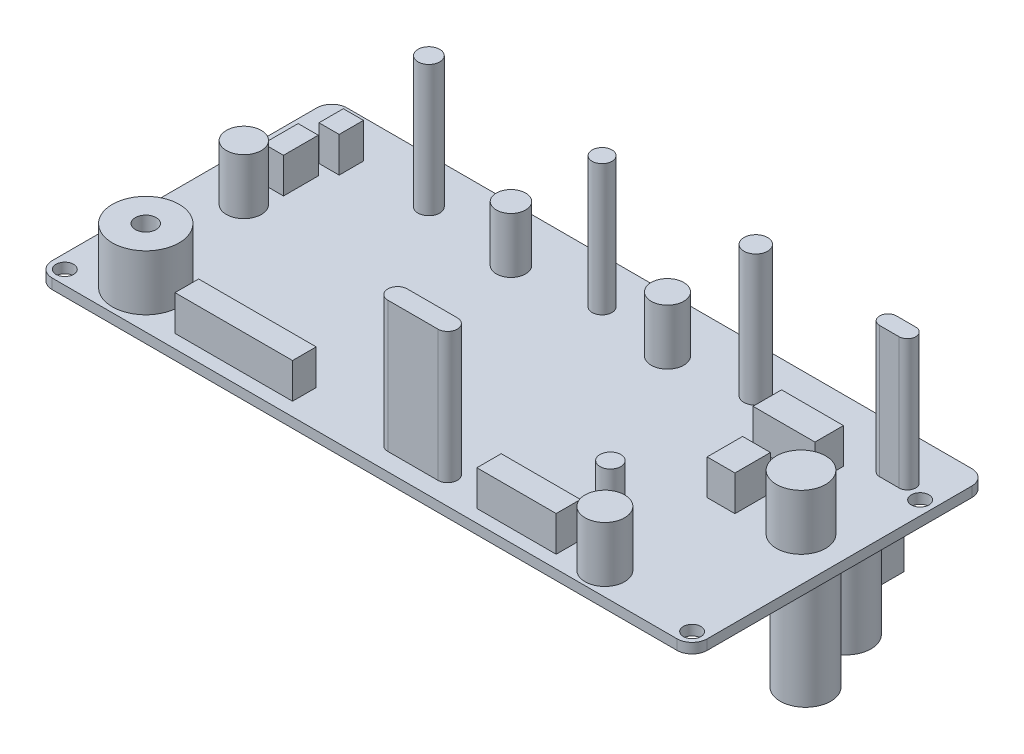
ISO-10303-21;
HEADER;
FILE_DESCRIPTION(('STEP AP214'),'2;1');
FILE_NAME('part.step','',(''),(''),'','','');
FILE_SCHEMA(('AUTOMOTIVE_DESIGN { 1 0 10303 214 1 1 1 1 }'));
ENDSEC;
DATA;
#1=APPLICATION_CONTEXT('core data for automotive mechanical design processes');
#2=APPLICATION_PROTOCOL_DEFINITION('international standard','automotive_design',2000,#1);
#3=PRODUCT_CONTEXT('',#1,'mechanical');
#4=PRODUCT('Part','Part','',(#3));
#5=PRODUCT_RELATED_PRODUCT_CATEGORY('part','',(#4));
#6=PRODUCT_DEFINITION_FORMATION('','',#4);
#7=PRODUCT_DEFINITION_CONTEXT('part definition',#1,'design');
#8=PRODUCT_DEFINITION('design','',#6,#7);
#9=PRODUCT_DEFINITION_SHAPE('','',#8);
#10=(LENGTH_UNIT() NAMED_UNIT(*) SI_UNIT(.MILLI.,.METRE.));
#11=(NAMED_UNIT(*) PLANE_ANGLE_UNIT() SI_UNIT($,.RADIAN.));
#12=(NAMED_UNIT(*) SI_UNIT($,.STERADIAN.) SOLID_ANGLE_UNIT());
#13=UNCERTAINTY_MEASURE_WITH_UNIT(LENGTH_MEASURE(1.E-05),#10,'distance_accuracy_value','');
#14=(GEOMETRIC_REPRESENTATION_CONTEXT(3) GLOBAL_UNCERTAINTY_ASSIGNED_CONTEXT((#13)) GLOBAL_UNIT_ASSIGNED_CONTEXT((#10,
#11,#12)) REPRESENTATION_CONTEXT('',''));
#15=CARTESIAN_POINT('',(0.,0.,0.));
#16=DIRECTION('',(0.,0.,1.));
#17=DIRECTION('',(1.,0.,0.));
#18=AXIS2_PLACEMENT_3D('',#15,#16,#17);
#19=CARTESIAN_POINT('',(0.,0.,0.));
#20=DIRECTION('',(0.,1.,0.));
#21=DIRECTION('',(0.,0.,1.));
#22=AXIS2_PLACEMENT_3D('',#19,#20,#21);
#23=PLANE('',#22);
#24=DIRECTION('',(0.,0.,1.));
#25=VECTOR('',#24,1.);
#26=CARTESIAN_POINT('',(45.,0.,-3.24999999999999));
#27=LINE('',#26,#25);
#28=CARTESIAN_POINT('',(45.,0.,-3.24999999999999));
#29=VERTEX_POINT('',#28);
#30=CARTESIAN_POINT('',(45.,0.,9.75000000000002));
#31=VERTEX_POINT('',#30);
#32=EDGE_CURVE('E510',#29,#31,#27,.T.);
#33=ORIENTED_EDGE('',*,*,#32,.T.);
#34=DIRECTION('',(-1.,0.,0.));
#35=VECTOR('',#34,1.);
#36=CARTESIAN_POINT('',(81.5858373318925,0.,9.75000000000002));
#37=LINE('',#36,#35);
#38=CARTESIAN_POINT('',(50.,0.,9.75000000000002));
#39=VERTEX_POINT('',#38);
#40=EDGE_CURVE('E542',#39,#31,#37,.T.);
#41=ORIENTED_EDGE('',*,*,#40,.F.);
#42=DIRECTION('',(0.,0.,-1.));
#43=VECTOR('',#42,1.);
#44=CARTESIAN_POINT('',(50.,0.,-3.24999999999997));
#45=LINE('',#44,#43);
#46=CARTESIAN_POINT('',(50.,0.,-3.24999999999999));
#47=VERTEX_POINT('',#46);
#48=EDGE_CURVE('E502',#39,#47,#45,.T.);
#49=ORIENTED_EDGE('',*,*,#48,.T.);
#50=DIRECTION('',(-1.,0.,0.));
#51=VECTOR('',#50,1.);
#52=CARTESIAN_POINT('',(81.5858373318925,0.,-3.24999999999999));
#53=LINE('',#52,#51);
#54=EDGE_CURVE('E545',#47,#29,#53,.T.);
#55=ORIENTED_EDGE('',*,*,#54,.T.);
#56=EDGE_LOOP('',(#33,#41,#49,#55));
#57=FACE_BOUND('',#56,.T.);
#58=DIRECTION('',(1.,0.,0.));
#59=VECTOR('',#58,1.);
#60=CARTESIAN_POINT('',(-81.5858373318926,0.,9.75000000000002));
#61=LINE('',#60,#59);
#62=CARTESIAN_POINT('',(-50.,0.,9.75000000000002));
#63=VERTEX_POINT('',#62);
#64=CARTESIAN_POINT('',(-45.,0.,9.75000000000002));
#65=VERTEX_POINT('',#64);
#66=EDGE_CURVE('E601',#63,#65,#61,.T.);
#67=ORIENTED_EDGE('',*,*,#66,.T.);
#68=DIRECTION('',(0.,0.,1.));
#69=VECTOR('',#68,1.);
#70=CARTESIAN_POINT('',(-45.,0.,-3.24999999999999));
#71=LINE('',#70,#69);
#72=CARTESIAN_POINT('',(-45.,0.,-3.24999999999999));
#73=VERTEX_POINT('',#72);
#74=EDGE_CURVE('E568',#73,#65,#71,.T.);
#75=ORIENTED_EDGE('',*,*,#74,.F.);
#76=DIRECTION('',(1.,0.,0.));
#77=VECTOR('',#76,1.);
#78=CARTESIAN_POINT('',(-81.5858373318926,0.,-3.24999999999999));
#79=LINE('',#78,#77);
#80=CARTESIAN_POINT('',(-50.,0.,-3.24999999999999));
#81=VERTEX_POINT('',#80);
#82=EDGE_CURVE('E589',#81,#73,#79,.T.);
#83=ORIENTED_EDGE('',*,*,#82,.F.);
#84=DIRECTION('',(0.,0.,-1.));
#85=VECTOR('',#84,1.);
#86=CARTESIAN_POINT('',(-50.,0.,-3.24999999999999));
#87=LINE('',#86,#85);
#88=EDGE_CURVE('E565',#63,#81,#87,.T.);
#89=ORIENTED_EDGE('',*,*,#88,.F.);
#90=EDGE_LOOP('',(#67,#75,#83,#89));
#91=FACE_BOUND('',#90,.T.);
#92=DIRECTION('',(-1.,0.,0.));
#93=VECTOR('',#92,1.);
#94=CARTESIAN_POINT('',(-65.,0.,-29.25));
#95=LINE('',#94,#93);
#96=CARTESIAN_POINT('',(62.,0.,-29.25));
#97=VERTEX_POINT('',#96);
#98=CARTESIAN_POINT('',(-62.,0.,-29.25));
#99=VERTEX_POINT('',#98);
#100=EDGE_CURVE('E946',#97,#99,#95,.T.);
#101=ORIENTED_EDGE('',*,*,#100,.F.);
#102=CARTESIAN_POINT('',(62.,0.,-26.25));
#103=DIRECTION('',(0.,1.,0.));
#104=DIRECTION('',(0.,0.,1.));
#105=AXIS2_PLACEMENT_3D('',#102,#103,#104);
#106=CIRCLE('',#105,3.);
#107=CARTESIAN_POINT('',(65.,0.,-26.25));
#108=VERTEX_POINT('',#107);
#109=EDGE_CURVE('E985',#97,#108,#106,.F.);
#110=ORIENTED_EDGE('',*,*,#109,.T.);
#111=DIRECTION('',(0.,0.,-1.));
#112=VECTOR('',#111,1.);
#113=CARTESIAN_POINT('',(65.,0.,-29.25));
#114=LINE('',#113,#112);
#115=CARTESIAN_POINT('',(65.,0.,26.25));
#116=VERTEX_POINT('',#115);
#117=EDGE_CURVE('E961',#116,#108,#114,.T.);
#118=ORIENTED_EDGE('',*,*,#117,.F.);
#119=CARTESIAN_POINT('',(62.,0.,26.25));
#120=DIRECTION('',(0.,1.,0.));
#121=DIRECTION('',(0.,0.,1.));
#122=AXIS2_PLACEMENT_3D('',#119,#120,#121);
#123=CIRCLE('',#122,3.);
#124=CARTESIAN_POINT('',(62.,0.,29.25));
#125=VERTEX_POINT('',#124);
#126=EDGE_CURVE('E983',#116,#125,#123,.F.);
#127=ORIENTED_EDGE('',*,*,#126,.T.);
#128=DIRECTION('',(1.,0.,0.));
#129=VECTOR('',#128,1.);
#130=CARTESIAN_POINT('',(-65.,0.,29.25));
#131=LINE('',#130,#129);
#132=CARTESIAN_POINT('',(-62.,0.,29.25));
#133=VERTEX_POINT('',#132);
#134=EDGE_CURVE('E958',#133,#125,#131,.T.);
#135=ORIENTED_EDGE('',*,*,#134,.F.);
#136=CARTESIAN_POINT('',(-62.,0.,26.25));
#137=DIRECTION('',(0.,1.,0.));
#138=DIRECTION('',(0.,0.,1.));
#139=AXIS2_PLACEMENT_3D('',#136,#137,#138);
#140=CIRCLE('',#139,3.);
#141=CARTESIAN_POINT('',(-65.,0.,26.25));
#142=VERTEX_POINT('',#141);
#143=EDGE_CURVE('E981',#133,#142,#140,.F.);
#144=ORIENTED_EDGE('',*,*,#143,.T.);
#145=DIRECTION('',(0.,0.,1.));
#146=VECTOR('',#145,1.);
#147=CARTESIAN_POINT('',(-65.,0.,-29.25));
#148=LINE('',#147,#146);
#149=CARTESIAN_POINT('',(-65.,0.,-26.25));
#150=VERTEX_POINT('',#149);
#151=EDGE_CURVE('E941',#150,#142,#148,.T.);
#152=ORIENTED_EDGE('',*,*,#151,.F.);
#153=CARTESIAN_POINT('',(-62.,0.,-26.25));
#154=DIRECTION('',(0.,1.,0.));
#155=DIRECTION('',(0.,0.,1.));
#156=AXIS2_PLACEMENT_3D('',#153,#154,#155);
#157=CIRCLE('',#156,3.);
#158=EDGE_CURVE('E979',#150,#99,#157,.F.);
#159=ORIENTED_EDGE('',*,*,#158,.T.);
#160=EDGE_LOOP('',(#101,#110,#118,#127,#135,#144,#152,#159));
#161=FACE_BOUND('',#160,.T.);
#162=CARTESIAN_POINT('',(59.,0.,0.750000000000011));
#163=DIRECTION('',(0.,1.,0.));
#164=DIRECTION('',(0.,0.,1.));
#165=AXIS2_PLACEMENT_3D('',#162,#163,#164);
#166=CIRCLE('',#165,5.);
#167=CARTESIAN_POINT('',(59.,0.,5.75000000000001));
#168=VERTEX_POINT('',#167);
#169=EDGE_CURVE('E968',#168,#168,#166,.F.);
#170=ORIENTED_EDGE('',*,*,#169,.F.);
#171=EDGE_LOOP('',(#170));
#172=FACE_BOUND('',#171,.T.);
#173=CARTESIAN_POINT('',(54.,0.,-12.25));
#174=DIRECTION('',(0.,1.,0.));
#175=DIRECTION('',(0.,0.,1.));
#176=AXIS2_PLACEMENT_3D('',#173,#174,#175);
#177=CIRCLE('',#176,5.);
#178=CARTESIAN_POINT('',(54.,0.,-7.25));
#179=VERTEX_POINT('',#178);
#180=EDGE_CURVE('E971',#179,#179,#177,.F.);
#181=ORIENTED_EDGE('',*,*,#180,.F.);
#182=EDGE_LOOP('',(#181));
#183=FACE_BOUND('',#182,.T.);
#184=DIRECTION('',(-1.,0.,0.));
#185=VECTOR('',#184,1.);
#186=CARTESIAN_POINT('',(-47.,0.,-16.75));
#187=LINE('',#186,#185);
#188=CARTESIAN_POINT('',(49.,0.,-16.75));
#189=VERTEX_POINT('',#188);
#190=CARTESIAN_POINT('',(-47.,0.,-16.75));
#191=VERTEX_POINT('',#190);
#192=EDGE_CURVE('E607',#189,#191,#187,.T.);
#193=ORIENTED_EDGE('',*,*,#192,.F.);
#194=DIRECTION('',(0.,0.,1.));
#195=VECTOR('',#194,1.);
#196=CARTESIAN_POINT('',(49.,0.,-16.75));
#197=LINE('',#196,#195);
#198=CARTESIAN_POINT('',(49.,0.,-28.75));
#199=VERTEX_POINT('',#198);
#200=EDGE_CURVE('E612',#199,#189,#197,.T.);
#201=ORIENTED_EDGE('',*,*,#200,.F.);
#202=DIRECTION('',(1.,0.,0.));
#203=VECTOR('',#202,1.);
#204=CARTESIAN_POINT('',(-47.,0.,-28.75));
#205=LINE('',#204,#203);
#206=CARTESIAN_POINT('',(-47.,0.,-28.75));
#207=VERTEX_POINT('',#206);
#208=EDGE_CURVE('E624',#207,#199,#205,.T.);
#209=ORIENTED_EDGE('',*,*,#208,.F.);
#210=DIRECTION('',(0.,0.,-1.));
#211=VECTOR('',#210,1.);
#212=CARTESIAN_POINT('',(-47.,0.,-16.75));
#213=LINE('',#212,#211);
#214=EDGE_CURVE('E621',#191,#207,#213,.T.);
#215=ORIENTED_EDGE('',*,*,#214,.F.);
#216=EDGE_LOOP('',(#193,#201,#209,#215));
#217=FACE_BOUND('',#216,.T.);
#218=CARTESIAN_POINT('',(-62.25,0.,-18.75));
#219=DIRECTION('',(0.,1.,0.));
#220=DIRECTION('',(0.,0.,1.));
#221=AXIS2_PLACEMENT_3D('',#218,#219,#220);
#222=CIRCLE('',#221,1.75);
#223=CARTESIAN_POINT('',(-62.25,0.,-17.));
#224=VERTEX_POINT('',#223);
#225=EDGE_CURVE('E473',#224,#224,#222,.T.);
#226=ORIENTED_EDGE('',*,*,#225,.T.);
#227=EDGE_LOOP('',(#226));
#228=FACE_BOUND('',#227,.T.);
#229=CARTESIAN_POINT('',(62.25,0.,-18.75));
#230=DIRECTION('',(0.,1.,0.));
#231=DIRECTION('',(0.,0.,1.));
#232=AXIS2_PLACEMENT_3D('',#229,#230,#231);
#233=CIRCLE('',#232,1.75);
#234=CARTESIAN_POINT('',(62.25,0.,-17.));
#235=VERTEX_POINT('',#234);
#236=EDGE_CURVE('E476',#235,#235,#233,.T.);
#237=ORIENTED_EDGE('',*,*,#236,.T.);
#238=EDGE_LOOP('',(#237));
#239=FACE_BOUND('',#238,.T.);
#240=CARTESIAN_POINT('',(62.25,0.,26.5));
#241=DIRECTION('',(0.,1.,0.));
#242=DIRECTION('',(0.,0.,1.));
#243=AXIS2_PLACEMENT_3D('',#240,#241,#242);
#244=CIRCLE('',#243,1.74999999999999);
#245=CARTESIAN_POINT('',(62.25,0.,28.25));
#246=VERTEX_POINT('',#245);
#247=EDGE_CURVE('E479',#246,#246,#244,.T.);
#248=ORIENTED_EDGE('',*,*,#247,.T.);
#249=EDGE_LOOP('',(#248));
#250=FACE_BOUND('',#249,.T.);
#251=CARTESIAN_POINT('',(-62.25,0.,26.5));
#252=DIRECTION('',(0.,1.,0.));
#253=DIRECTION('',(0.,0.,1.));
#254=AXIS2_PLACEMENT_3D('',#251,#252,#253);
#255=CIRCLE('',#254,1.75);
#256=CARTESIAN_POINT('',(-62.25,0.,28.25));
#257=VERTEX_POINT('',#256);
#258=EDGE_CURVE('E482',#257,#257,#255,.T.);
#259=ORIENTED_EDGE('',*,*,#258,.T.);
#260=EDGE_LOOP('',(#259));
#261=FACE_BOUND('',#260,.T.);
#262=DIRECTION('',(0.,0.,-1.));
#263=VECTOR('',#262,1.);
#264=CARTESIAN_POINT('',(-37.,0.,25.25));
#265=LINE('',#264,#263);
#266=CARTESIAN_POINT('',(-37.,0.,25.25));
#267=VERTEX_POINT('',#266);
#268=CARTESIAN_POINT('',(-37.,0.,22.25));
#269=VERTEX_POINT('',#268);
#270=EDGE_CURVE('E455',#267,#269,#265,.T.);
#271=ORIENTED_EDGE('',*,*,#270,.F.);
#272=DIRECTION('',(-1.,0.,0.));
#273=VECTOR('',#272,1.);
#274=CARTESIAN_POINT('',(-37.,0.,25.25));
#275=LINE('',#274,#273);
#276=CARTESIAN_POINT('',(40.,0.,25.25));
#277=VERTEX_POINT('',#276);
#278=EDGE_CURVE('E452',#277,#267,#275,.T.);
#279=ORIENTED_EDGE('',*,*,#278,.F.);
#280=DIRECTION('',(0.,0.,1.));
#281=VECTOR('',#280,1.);
#282=CARTESIAN_POINT('',(40.,0.,25.25));
#283=LINE('',#282,#281);
#284=CARTESIAN_POINT('',(40.,0.,22.25));
#285=VERTEX_POINT('',#284);
#286=EDGE_CURVE('E55',#285,#277,#283,.T.);
#287=ORIENTED_EDGE('',*,*,#286,.F.);
#288=DIRECTION('',(1.,0.,0.));
#289=VECTOR('',#288,1.);
#290=CARTESIAN_POINT('',(-37.,0.,22.25));
#291=LINE('',#290,#289);
#292=EDGE_CURVE('E50',#269,#285,#291,.T.);
#293=ORIENTED_EDGE('',*,*,#292,.F.);
#294=EDGE_LOOP('',(#271,#279,#287,#293));
#295=FACE_BOUND('',#294,.T.);
#296=ADVANCED_FACE('F35',(#57,#91,#161,#172,#183,#217,#228,#239,#250,#261,#295),#23,.F.);
#297=CARTESIAN_POINT('',(0.,2.,0.));
#298=DIRECTION('',(0.,1.,0.));
#299=DIRECTION('',(0.,0.,1.));
#300=AXIS2_PLACEMENT_3D('',#297,#298,#299);
#301=PLANE('',#300);
#302=CARTESIAN_POINT('',(-62.25,2.,26.5));
#303=DIRECTION('',(0.,1.,0.));
#304=DIRECTION('',(0.,0.,1.));
#305=AXIS2_PLACEMENT_3D('',#302,#303,#304);
#306=CIRCLE('',#305,1.75);
#307=CARTESIAN_POINT('',(-62.25,2.,28.25));
#308=VERTEX_POINT('',#307);
#309=EDGE_CURVE('E456',#308,#308,#306,.T.);
#310=ORIENTED_EDGE('',*,*,#309,.F.);
#311=EDGE_LOOP('',(#310));
#312=FACE_BOUND('',#311,.T.);
#313=CARTESIAN_POINT('',(62.25,2.,26.5));
#314=DIRECTION('',(0.,1.,0.));
#315=DIRECTION('',(0.,0.,1.));
#316=AXIS2_PLACEMENT_3D('',#313,#314,#315);
#317=CIRCLE('',#316,1.74999999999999);
#318=CARTESIAN_POINT('',(62.25,2.,28.25));
#319=VERTEX_POINT('',#318);
#320=EDGE_CURVE('E459',#319,#319,#317,.T.);
#321=ORIENTED_EDGE('',*,*,#320,.F.);
#322=EDGE_LOOP('',(#321));
#323=FACE_BOUND('',#322,.T.);
#324=CARTESIAN_POINT('',(62.25,2.,-18.75));
#325=DIRECTION('',(0.,1.,0.));
#326=DIRECTION('',(0.,0.,1.));
#327=AXIS2_PLACEMENT_3D('',#324,#325,#326);
#328=CIRCLE('',#327,1.75);
#329=CARTESIAN_POINT('',(62.25,2.,-17.));
#330=VERTEX_POINT('',#329);
#331=EDGE_CURVE('E465',#330,#330,#328,.T.);
#332=ORIENTED_EDGE('',*,*,#331,.F.);
#333=EDGE_LOOP('',(#332));
#334=FACE_BOUND('',#333,.T.);
#335=CARTESIAN_POINT('',(-62.25,2.,-18.75));
#336=DIRECTION('',(0.,1.,0.));
#337=DIRECTION('',(0.,0.,1.));
#338=AXIS2_PLACEMENT_3D('',#335,#336,#337);
#339=CIRCLE('',#338,1.75);
#340=CARTESIAN_POINT('',(-62.25,2.,-17.));
#341=VERTEX_POINT('',#340);
#342=EDGE_CURVE('E468',#341,#341,#339,.T.);
#343=ORIENTED_EDGE('',*,*,#342,.F.);
#344=EDGE_LOOP('',(#343));
#345=FACE_BOUND('',#344,.T.);
#346=CARTESIAN_POINT('',(28.0255180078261,2.,-20.3633689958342));
#347=DIRECTION('',(0.,1.,0.));
#348=DIRECTION('',(0.,0.,1.));
#349=AXIS2_PLACEMENT_3D('',#346,#347,#348);
#350=CIRCLE('',#349,2.35102154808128);
#351=CARTESIAN_POINT('',(28.0255180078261,2.,-18.0123474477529));
#352=VERTEX_POINT('',#351);
#353=EDGE_CURVE('E704',#352,#352,#350,.T.);
#354=ORIENTED_EDGE('',*,*,#353,.F.);
#355=EDGE_LOOP('',(#354));
#356=FACE_BOUND('',#355,.T.);
#357=CARTESIAN_POINT('',(-2.48502130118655,2.,-20.3633689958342));
#358=DIRECTION('',(0.,1.,0.));
#359=DIRECTION('',(0.,0.,1.));
#360=AXIS2_PLACEMENT_3D('',#357,#358,#359);
#361=CIRCLE('',#360,1.9621549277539);
#362=CARTESIAN_POINT('',(-2.48502130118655,2.,-18.4012140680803));
#363=VERTEX_POINT('',#362);
#364=EDGE_CURVE('E708',#363,#363,#361,.T.);
#365=ORIENTED_EDGE('',*,*,#364,.F.);
#366=EDGE_LOOP('',(#365));
#367=FACE_BOUND('',#366,.T.);
#368=CARTESIAN_POINT('',(-36.8611493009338,2.,-20.3633689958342));
#369=DIRECTION('',(0.,1.,0.));
#370=DIRECTION('',(0.,0.,1.));
#371=AXIS2_PLACEMENT_3D('',#368,#369,#370);
#372=CIRCLE('',#371,2.16092977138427);
#373=CARTESIAN_POINT('',(-36.8611493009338,2.,-18.2024392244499));
#374=VERTEX_POINT('',#373);
#375=EDGE_CURVE('E714',#374,#374,#372,.T.);
#376=ORIENTED_EDGE('',*,*,#375,.F.);
#377=EDGE_LOOP('',(#376));
#378=FACE_BOUND('',#377,.T.);
#379=CARTESIAN_POINT('',(35.7566953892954,2.,16.22166682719));
#380=DIRECTION('',(0.,1.,0.));
#381=DIRECTION('',(0.,0.,1.));
#382=AXIS2_PLACEMENT_3D('',#379,#380,#381);
#383=CIRCLE('',#382,2.07085108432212);
#384=CARTESIAN_POINT('',(35.7566953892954,2.,18.2925179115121));
#385=VERTEX_POINT('',#384);
#386=EDGE_CURVE('E720',#385,#385,#383,.T.);
#387=ORIENTED_EDGE('',*,*,#386,.F.);
#388=EDGE_LOOP('',(#387));
#389=FACE_BOUND('',#388,.T.);
#390=CARTESIAN_POINT('',(12.4251065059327,2.,-18.4305746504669));
#391=DIRECTION('',(0.,1.,0.));
#392=DIRECTION('',(0.,0.,1.));
#393=AXIS2_PLACEMENT_3D('',#390,#391,#392);
#394=CIRCLE('',#393,3.23477280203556);
#395=CARTESIAN_POINT('',(12.4251065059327,2.,-15.1958018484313));
#396=VERTEX_POINT('',#395);
#397=EDGE_CURVE('E726',#396,#396,#394,.T.);
#398=ORIENTED_EDGE('',*,*,#397,.F.);
#399=EDGE_LOOP('',(#398));
#400=FACE_BOUND('',#399,.T.);
#401=CARTESIAN_POINT('',(-18.6376597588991,2.,-18.4305746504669));
#402=DIRECTION('',(0.,1.,0.));
#403=DIRECTION('',(0.,0.,1.));
#404=AXIS2_PLACEMENT_3D('',#401,#402,#403);
#405=CIRCLE('',#404,2.9123100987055);
#406=CARTESIAN_POINT('',(-18.6376597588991,2.,-15.5182645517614));
#407=VERTEX_POINT('',#406);
#408=EDGE_CURVE('E732',#407,#407,#405,.T.);
#409=ORIENTED_EDGE('',*,*,#408,.F.);
#410=EDGE_LOOP('',(#409));
#411=FACE_BOUND('',#410,.T.);
#412=CARTESIAN_POINT('',(-55.6368657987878,2.,-2.41599293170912));
#413=DIRECTION('',(0.,1.,0.));
#414=DIRECTION('',(0.,0.,1.));
#415=AXIS2_PLACEMENT_3D('',#412,#413,#414);
#416=CIRCLE('',#415,3.46588411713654);
#417=CARTESIAN_POINT('',(-55.6368657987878,2.,1.04989118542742));
#418=VERTEX_POINT('',#417);
#419=EDGE_CURVE('E738',#418,#418,#416,.T.);
#420=ORIENTED_EDGE('',*,*,#419,.F.);
#421=EDGE_LOOP('',(#420));
#422=FACE_BOUND('',#421,.T.);
#423=CARTESIAN_POINT('',(-51.0809934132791,2.,21.6058796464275));
#424=DIRECTION('',(0.,1.,0.));
#425=DIRECTION('',(0.,0.,1.));
#426=AXIS2_PLACEMENT_3D('',#423,#424,#425);
#427=CIRCLE('',#426,6.6267234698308);
#428=CARTESIAN_POINT('',(-51.0809934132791,2.,28.2326031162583));
#429=VERTEX_POINT('',#428);
#430=EDGE_CURVE('E749',#429,#429,#427,.T.);
#431=ORIENTED_EDGE('',*,*,#430,.F.);
#432=EDGE_LOOP('',(#431));
#433=FACE_BOUND('',#432,.T.);
#434=CARTESIAN_POINT('',(43.0737025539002,2.,24.6431279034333));
#435=DIRECTION('',(0.,1.,0.));
#436=DIRECTION('',(0.,0.,1.));
#437=AXIS2_PLACEMENT_3D('',#434,#435,#436);
#438=CIRCLE('',#437,3.9291636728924);
#439=CARTESIAN_POINT('',(43.0737025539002,2.,28.5722915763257));
#440=VERTEX_POINT('',#439);
#441=EDGE_CURVE('E753',#440,#440,#438,.T.);
#442=ORIENTED_EDGE('',*,*,#441,.F.);
#443=EDGE_LOOP('',(#442));
#444=FACE_BOUND('',#443,.T.);
#445=CARTESIAN_POINT('',(56.3271494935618,2.,-1.03542554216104));
#446=DIRECTION('',(0.,1.,0.));
#447=DIRECTION('',(0.,0.,1.));
#448=AXIS2_PLACEMENT_3D('',#445,#446,#447);
#449=CIRCLE('',#448,4.89663724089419);
#450=CARTESIAN_POINT('',(56.3271494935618,2.,3.86121169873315));
#451=VERTEX_POINT('',#450);
#452=EDGE_CURVE('E759',#451,#451,#449,.T.);
#453=ORIENTED_EDGE('',*,*,#452,.F.);
#454=EDGE_LOOP('',(#453));
#455=FACE_BOUND('',#454,.T.);
#456=DIRECTION('',(0.,0.,-1.));
#457=VECTOR('',#456,1.);
#458=CARTESIAN_POINT('',(65.,2.,-29.25));
#459=LINE('',#458,#457);
#460=CARTESIAN_POINT('',(65.,2.,26.25));
#461=VERTEX_POINT('',#460);
#462=CARTESIAN_POINT('',(65.,2.,-26.25));
#463=VERTEX_POINT('',#462);
#464=EDGE_CURVE('E949',#461,#463,#459,.T.);
#465=ORIENTED_EDGE('',*,*,#464,.T.);
#466=CARTESIAN_POINT('',(62.,2.,-26.25));
#467=DIRECTION('',(0.,1.,0.));
#468=DIRECTION('',(0.,0.,1.));
#469=AXIS2_PLACEMENT_3D('',#466,#467,#468);
#470=CIRCLE('',#469,3.);
#471=CARTESIAN_POINT('',(62.,2.,-29.25));
#472=VERTEX_POINT('',#471);
#473=EDGE_CURVE('E998',#463,#472,#470,.T.);
#474=ORIENTED_EDGE('',*,*,#473,.T.);
#475=DIRECTION('',(-1.,0.,0.));
#476=VECTOR('',#475,1.);
#477=CARTESIAN_POINT('',(-65.,2.,-29.25));
#478=LINE('',#477,#476);
#479=CARTESIAN_POINT('',(-62.,2.,-29.25));
#480=VERTEX_POINT('',#479);
#481=EDGE_CURVE('E952',#472,#480,#478,.T.);
#482=ORIENTED_EDGE('',*,*,#481,.T.);
#483=CARTESIAN_POINT('',(-62.,2.,-26.25));
#484=DIRECTION('',(0.,1.,0.));
#485=DIRECTION('',(0.,0.,1.));
#486=AXIS2_PLACEMENT_3D('',#483,#484,#485);
#487=CIRCLE('',#486,3.);
#488=CARTESIAN_POINT('',(-65.,2.,-26.25));
#489=VERTEX_POINT('',#488);
#490=EDGE_CURVE('E992',#480,#489,#487,.T.);
#491=ORIENTED_EDGE('',*,*,#490,.T.);
#492=DIRECTION('',(0.,0.,1.));
#493=VECTOR('',#492,1.);
#494=CARTESIAN_POINT('',(-65.,2.,-29.25));
#495=LINE('',#494,#493);
#496=CARTESIAN_POINT('',(-65.,2.,26.25));
#497=VERTEX_POINT('',#496);
#498=EDGE_CURVE('E942',#489,#497,#495,.T.);
#499=ORIENTED_EDGE('',*,*,#498,.T.);
#500=CARTESIAN_POINT('',(-62.,2.,26.25));
#501=DIRECTION('',(0.,1.,0.));
#502=DIRECTION('',(0.,0.,1.));
#503=AXIS2_PLACEMENT_3D('',#500,#501,#502);
#504=CIRCLE('',#503,3.);
#505=CARTESIAN_POINT('',(-62.,2.,29.25));
#506=VERTEX_POINT('',#505);
#507=EDGE_CURVE('E994',#497,#506,#504,.T.);
#508=ORIENTED_EDGE('',*,*,#507,.T.);
#509=DIRECTION('',(1.,0.,0.));
#510=VECTOR('',#509,1.);
#511=CARTESIAN_POINT('',(-65.,2.,29.25));
#512=LINE('',#511,#510);
#513=CARTESIAN_POINT('',(62.,2.,29.25));
#514=VERTEX_POINT('',#513);
#515=EDGE_CURVE('E945',#506,#514,#512,.T.);
#516=ORIENTED_EDGE('',*,*,#515,.T.);
#517=CARTESIAN_POINT('',(62.,2.,26.25));
#518=DIRECTION('',(0.,1.,0.));
#519=DIRECTION('',(0.,0.,1.));
#520=AXIS2_PLACEMENT_3D('',#517,#518,#519);
#521=CIRCLE('',#520,3.);
#522=EDGE_CURVE('E996',#514,#461,#521,.T.);
#523=ORIENTED_EDGE('',*,*,#522,.T.);
#524=EDGE_LOOP('',(#465,#474,#482,#491,#499,#508,#516,#523));
#525=FACE_BOUND('',#524,.T.);
#526=DIRECTION('',(0.,0.,1.));
#527=VECTOR('',#526,1.);
#528=CARTESIAN_POINT('',(-55.2226955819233,2.,-21.7439363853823));
#529=LINE('',#528,#527);
#530=CARTESIAN_POINT('',(-55.2226955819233,2.,-21.7439363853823));
#531=VERTEX_POINT('',#530);
#532=CARTESIAN_POINT('',(-55.2226955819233,2.,-16.911950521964));
#533=VERTEX_POINT('',#532);
#534=EDGE_CURVE('E926',#531,#533,#529,.T.);
#535=ORIENTED_EDGE('',*,*,#534,.F.);
#536=DIRECTION('',(-1.,0.,0.));
#537=VECTOR('',#536,1.);
#538=CARTESIAN_POINT('',(-55.2226955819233,2.,-21.7439363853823));
#539=LINE('',#538,#537);
#540=CARTESIAN_POINT('',(-51.2190501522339,2.,-21.7439363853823));
#541=VERTEX_POINT('',#540);
#542=EDGE_CURVE('E912',#541,#531,#539,.T.);
#543=ORIENTED_EDGE('',*,*,#542,.F.);
#544=DIRECTION('',(0.,0.,-1.));
#545=VECTOR('',#544,1.);
#546=CARTESIAN_POINT('',(-51.2190501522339,2.,-21.7439363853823));
#547=LINE('',#546,#545);
#548=CARTESIAN_POINT('',(-51.2190501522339,2.,-16.911950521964));
#549=VERTEX_POINT('',#548);
#550=EDGE_CURVE('E917',#549,#541,#547,.T.);
#551=ORIENTED_EDGE('',*,*,#550,.F.);
#552=DIRECTION('',(1.,0.,0.));
#553=VECTOR('',#552,1.);
#554=CARTESIAN_POINT('',(-55.2226955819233,2.,-16.911950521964));
#555=LINE('',#554,#553);
#556=EDGE_CURVE('E928',#533,#549,#555,.T.);
#557=ORIENTED_EDGE('',*,*,#556,.F.);
#558=EDGE_LOOP('',(#535,#543,#551,#557));
#559=FACE_BOUND('',#558,.T.);
#560=DIRECTION('',(0.,0.,1.));
#561=VECTOR('',#560,1.);
#562=CARTESIAN_POINT('',(-57.1554899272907,2.,-14.7030426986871));
#563=LINE('',#562,#561);
#564=CARTESIAN_POINT('',(-57.1554899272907,2.,-14.7030426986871));
#565=VERTEX_POINT('',#564);
#566=CARTESIAN_POINT('',(-57.1554899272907,2.,-7.80020575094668));
#567=VERTEX_POINT('',#566);
#568=EDGE_CURVE('E897',#565,#567,#563,.T.);
#569=ORIENTED_EDGE('',*,*,#568,.F.);
#570=DIRECTION('',(-1.,0.,0.));
#571=VECTOR('',#570,1.);
#572=CARTESIAN_POINT('',(-57.1554899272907,2.,-14.7030426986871));
#573=LINE('',#572,#571);
#574=CARTESIAN_POINT('',(-53.1518444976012,2.,-14.7030426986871));
#575=VERTEX_POINT('',#574);
#576=EDGE_CURVE('E883',#575,#565,#573,.T.);
#577=ORIENTED_EDGE('',*,*,#576,.F.);
#578=DIRECTION('',(0.,0.,-1.));
#579=VECTOR('',#578,1.);
#580=CARTESIAN_POINT('',(-53.1518444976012,2.,-14.7030426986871));
#581=LINE('',#580,#579);
#582=CARTESIAN_POINT('',(-53.1518444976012,2.,-7.80020575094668));
#583=VERTEX_POINT('',#582);
#584=EDGE_CURVE('E888',#583,#575,#581,.T.);
#585=ORIENTED_EDGE('',*,*,#584,.F.);
#586=DIRECTION('',(1.,0.,0.));
#587=VECTOR('',#586,1.);
#588=CARTESIAN_POINT('',(-57.1554899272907,2.,-7.80020575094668));
#589=LINE('',#588,#587);
#590=EDGE_CURVE('E899',#567,#583,#589,.T.);
#591=ORIENTED_EDGE('',*,*,#590,.F.);
#592=EDGE_LOOP('',(#569,#577,#585,#591));
#593=FACE_BOUND('',#592,.T.);
#594=DIRECTION('',(1.,0.,0.));
#595=VECTOR('',#594,1.);
#596=CARTESIAN_POINT('',(-40.312567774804,2.,26.5759222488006));
#597=LINE('',#596,#595);
#598=CARTESIAN_POINT('',(-40.312567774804,2.,26.5759222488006));
#599=VERTEX_POINT('',#598);
#600=CARTESIAN_POINT('',(-16.9809788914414,2.,26.5759222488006));
#601=VERTEX_POINT('',#600);
#602=EDGE_CURVE('E868',#599,#601,#597,.T.);
#603=ORIENTED_EDGE('',*,*,#602,.F.);
#604=DIRECTION('',(0.,0.,1.));
#605=VECTOR('',#604,1.);
#606=CARTESIAN_POINT('',(-40.312567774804,2.,21.8819931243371));
#607=LINE('',#606,#605);
#608=CARTESIAN_POINT('',(-40.312567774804,2.,21.8819931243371));
#609=VERTEX_POINT('',#608);
#610=EDGE_CURVE('E854',#609,#599,#607,.T.);
#611=ORIENTED_EDGE('',*,*,#610,.F.);
#612=DIRECTION('',(-1.,0.,0.));
#613=VECTOR('',#612,1.);
#614=CARTESIAN_POINT('',(-40.312567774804,2.,21.8819931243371));
#615=LINE('',#614,#613);
#616=CARTESIAN_POINT('',(-16.9809788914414,2.,21.8819931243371));
#617=VERTEX_POINT('',#616);
#618=EDGE_CURVE('E859',#617,#609,#615,.T.);
#619=ORIENTED_EDGE('',*,*,#618,.F.);
#620=DIRECTION('',(0.,0.,-1.));
#621=VECTOR('',#620,1.);
#622=CARTESIAN_POINT('',(-16.9809788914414,2.,21.8819931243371));
#623=LINE('',#622,#621);
#624=EDGE_CURVE('E870',#601,#617,#623,.T.);
#625=ORIENTED_EDGE('',*,*,#624,.F.);
#626=EDGE_LOOP('',(#603,#611,#619,#625));
#627=FACE_BOUND('',#626,.T.);
#628=DIRECTION('',(1.,0.,0.));
#629=VECTOR('',#628,1.);
#630=CARTESIAN_POINT('',(19.7421136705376,2.,26.7139789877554));
#631=LINE('',#630,#629);
#632=CARTESIAN_POINT('',(19.7421136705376,2.,26.7139789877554));
#633=VERTEX_POINT('',#632);
#634=CARTESIAN_POINT('',(35.4805819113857,2.,26.7139789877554));
#635=VERTEX_POINT('',#634);
#636=EDGE_CURVE('E839',#633,#635,#631,.T.);
#637=ORIENTED_EDGE('',*,*,#636,.F.);
#638=DIRECTION('',(0.,0.,1.));
#639=VECTOR('',#638,1.);
#640=CARTESIAN_POINT('',(19.7421136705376,2.,21.8819931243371));
#641=LINE('',#640,#639);
#642=CARTESIAN_POINT('',(19.7421136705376,2.,21.8819931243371));
#643=VERTEX_POINT('',#642);
#644=EDGE_CURVE('E825',#643,#633,#641,.T.);
#645=ORIENTED_EDGE('',*,*,#644,.F.);
#646=DIRECTION('',(-1.,0.,0.));
#647=VECTOR('',#646,1.);
#648=CARTESIAN_POINT('',(19.7421136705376,2.,21.8819931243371));
#649=LINE('',#648,#647);
#650=CARTESIAN_POINT('',(35.4805819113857,2.,21.8819931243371));
#651=VERTEX_POINT('',#650);
#652=EDGE_CURVE('E830',#651,#643,#649,.T.);
#653=ORIENTED_EDGE('',*,*,#652,.F.);
#654=DIRECTION('',(0.,0.,-1.));
#655=VECTOR('',#654,1.);
#656=CARTESIAN_POINT('',(35.4805819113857,2.,21.8819931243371));
#657=LINE('',#656,#655);
#658=EDGE_CURVE('E841',#635,#651,#657,.T.);
#659=ORIENTED_EDGE('',*,*,#658,.F.);
#660=EDGE_LOOP('',(#637,#645,#653,#659));
#661=FACE_BOUND('',#660,.T.);
#662=DIRECTION('',(1.,0.,0.));
#663=VECTOR('',#662,1.);
#664=CARTESIAN_POINT('',(40.7267379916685,2.,2.00182271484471));
#665=LINE('',#664,#663);
#666=CARTESIAN_POINT('',(40.7267379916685,2.,2.00182271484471));
#667=VERTEX_POINT('',#666);
#668=CARTESIAN_POINT('',(46.2490075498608,2.,2.00182271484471));
#669=VERTEX_POINT('',#668);
#670=EDGE_CURVE('E810',#667,#669,#665,.T.);
#671=ORIENTED_EDGE('',*,*,#670,.F.);
#672=DIRECTION('',(0.,0.,1.));
#673=VECTOR('',#672,1.);
#674=CARTESIAN_POINT('',(40.7267379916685,2.,-5.03907097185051));
#675=LINE('',#674,#673);
#676=CARTESIAN_POINT('',(40.7267379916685,2.,-5.03907097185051));
#677=VERTEX_POINT('',#676);
#678=EDGE_CURVE('E796',#677,#667,#675,.T.);
#679=ORIENTED_EDGE('',*,*,#678,.F.);
#680=DIRECTION('',(-1.,0.,0.));
#681=VECTOR('',#680,1.);
#682=CARTESIAN_POINT('',(40.7267379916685,2.,-5.03907097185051));
#683=LINE('',#682,#681);
#684=CARTESIAN_POINT('',(46.2490075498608,2.,-5.03907097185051));
#685=VERTEX_POINT('',#684);
#686=EDGE_CURVE('E801',#685,#677,#683,.T.);
#687=ORIENTED_EDGE('',*,*,#686,.F.);
#688=DIRECTION('',(0.,0.,-1.));
#689=VECTOR('',#688,1.);
#690=CARTESIAN_POINT('',(46.2490075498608,2.,-5.03907097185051));
#691=LINE('',#690,#689);
#692=EDGE_CURVE('E812',#669,#685,#691,.T.);
#693=ORIENTED_EDGE('',*,*,#692,.F.);
#694=EDGE_LOOP('',(#671,#679,#687,#693));
#695=FACE_BOUND('',#694,.T.);
#696=DIRECTION('',(0.,0.,1.));
#697=VECTOR('',#696,1.);
#698=CARTESIAN_POINT('',(36.5850358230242,2.,-16.911950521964));
#699=LINE('',#698,#697);
#700=CARTESIAN_POINT('',(36.5850358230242,2.,-16.911950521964));
#701=VERTEX_POINT('',#700);
#702=CARTESIAN_POINT('',(36.5850358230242,2.,-11.2516242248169));
#703=VERTEX_POINT('',#702);
#704=EDGE_CURVE('E781',#701,#703,#699,.T.);
#705=ORIENTED_EDGE('',*,*,#704,.F.);
#706=DIRECTION('',(-1.,0.,0.));
#707=VECTOR('',#706,1.);
#708=CARTESIAN_POINT('',(36.5850358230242,2.,-16.911950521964));
#709=LINE('',#708,#707);
#710=CARTESIAN_POINT('',(48.8720855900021,2.,-16.911950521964));
#711=VERTEX_POINT('',#710);
#712=EDGE_CURVE('E765',#711,#701,#709,.T.);
#713=ORIENTED_EDGE('',*,*,#712,.F.);
#714=DIRECTION('',(0.,0.,-1.));
#715=VECTOR('',#714,1.);
#716=CARTESIAN_POINT('',(48.8720855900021,2.,-16.911950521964));
#717=LINE('',#716,#715);
#718=CARTESIAN_POINT('',(48.8720855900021,2.,-11.2516242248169));
#719=VERTEX_POINT('',#718);
#720=EDGE_CURVE('E772',#719,#711,#717,.T.);
#721=ORIENTED_EDGE('',*,*,#720,.F.);
#722=DIRECTION('',(1.,0.,0.));
#723=VECTOR('',#722,1.);
#724=CARTESIAN_POINT('',(36.5850358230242,2.,-11.2516242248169));
#725=LINE('',#724,#723);
#726=EDGE_CURVE('E783',#703,#719,#725,.T.);
#727=ORIENTED_EDGE('',*,*,#726,.F.);
#728=EDGE_LOOP('',(#705,#713,#721,#727));
#729=FACE_BOUND('',#728,.T.);
#730=DIRECTION('',(1.,0.,0.));
#731=VECTOR('',#730,1.);
#732=CARTESIAN_POINT('',(54.2562984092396,2.,-18.7066881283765));
#733=LINE('',#732,#731);
#734=CARTESIAN_POINT('',(54.2562984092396,2.,-18.7066881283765));
#735=VERTEX_POINT('',#734);
#736=CARTESIAN_POINT('',(58.1218870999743,2.,-18.7066881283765));
#737=VERTEX_POINT('',#736);
#738=EDGE_CURVE('E689',#735,#737,#733,.T.);
#739=ORIENTED_EDGE('',*,*,#738,.F.);
#740=CARTESIAN_POINT('',(54.2562984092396,2.,-20.3633689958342));
#741=DIRECTION('',(0.,1.,0.));
#742=DIRECTION('',(0.,0.,1.));
#743=AXIS2_PLACEMENT_3D('',#740,#741,#742);
#744=CIRCLE('',#743,1.6566808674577);
#745=CARTESIAN_POINT('',(54.2562984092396,2.,-22.0200498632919));
#746=VERTEX_POINT('',#745);
#747=EDGE_CURVE('E675',#746,#735,#744,.T.);
#748=ORIENTED_EDGE('',*,*,#747,.F.);
#749=DIRECTION('',(-1.,0.,0.));
#750=VECTOR('',#749,1.);
#751=CARTESIAN_POINT('',(54.2562984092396,2.,-22.0200498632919));
#752=LINE('',#751,#750);
#753=CARTESIAN_POINT('',(58.1218870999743,2.,-22.0200498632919));
#754=VERTEX_POINT('',#753);
#755=EDGE_CURVE('E680',#754,#746,#752,.T.);
#756=ORIENTED_EDGE('',*,*,#755,.F.);
#757=CARTESIAN_POINT('',(58.1218870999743,2.,-20.3633689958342));
#758=DIRECTION('',(0.,1.,0.));
#759=DIRECTION('',(0.,0.,1.));
#760=AXIS2_PLACEMENT_3D('',#757,#758,#759);
#761=CIRCLE('',#760,1.6566808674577);
#762=EDGE_CURVE('E691',#737,#754,#761,.T.);
#763=ORIENTED_EDGE('',*,*,#762,.F.);
#764=EDGE_LOOP('',(#739,#748,#756,#763));
#765=FACE_BOUND('',#764,.T.);
#766=DIRECTION('',(1.,0.,0.));
#767=VECTOR('',#766,1.);
#768=CARTESIAN_POINT('',(1.10445391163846,2.,25.7475818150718));
#769=LINE('',#768,#767);
#770=CARTESIAN_POINT('',(1.10445391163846,2.,25.7475818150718));
#771=VERTEX_POINT('',#770);
#772=CARTESIAN_POINT('',(11.0445391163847,2.,25.7475818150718));
#773=VERTEX_POINT('',#772);
#774=EDGE_CURVE('E660',#771,#773,#769,.T.);
#775=ORIENTED_EDGE('',*,*,#774,.F.);
#776=CARTESIAN_POINT('',(1.10445391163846,2.,23.8147874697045));
#777=DIRECTION('',(0.,1.,0.));
#778=DIRECTION('',(0.,0.,1.));
#779=AXIS2_PLACEMENT_3D('',#776,#777,#778);
#780=CIRCLE('',#779,1.93279434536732);
#781=CARTESIAN_POINT('',(1.10445391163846,2.,21.8819931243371));
#782=VERTEX_POINT('',#781);
#783=EDGE_CURVE('E646',#782,#771,#780,.T.);
#784=ORIENTED_EDGE('',*,*,#783,.F.);
#785=DIRECTION('',(-1.,0.,0.));
#786=VECTOR('',#785,1.);
#787=CARTESIAN_POINT('',(1.10445391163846,2.,21.8819931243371));
#788=LINE('',#787,#786);
#789=CARTESIAN_POINT('',(11.0445391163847,2.,21.8819931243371));
#790=VERTEX_POINT('',#789);
#791=EDGE_CURVE('E651',#790,#782,#788,.T.);
#792=ORIENTED_EDGE('',*,*,#791,.F.);
#793=CARTESIAN_POINT('',(11.0445391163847,2.,23.8147874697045));
#794=DIRECTION('',(0.,1.,0.));
#795=DIRECTION('',(0.,0.,1.));
#796=AXIS2_PLACEMENT_3D('',#793,#794,#795);
#797=CIRCLE('',#796,1.93279434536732);
#798=EDGE_CURVE('E662',#773,#790,#797,.T.);
#799=ORIENTED_EDGE('',*,*,#798,.F.);
#800=EDGE_LOOP('',(#775,#784,#792,#799));
#801=FACE_BOUND('',#800,.T.);
#802=ADVANCED_FACE('F1027',(#312,#323,#334,#345,#356,#367,#378,#389,#400,#411,#422,#433,#444,
#455,#525,#559,#593,#627,#661,#695,#729,#765,#801),#301,.T.);
#803=CARTESIAN_POINT('',(-65.,2.,-29.25));
#804=DIRECTION('',(1.,0.,0.));
#805=DIRECTION('',(0.,0.,-1.));
#806=AXIS2_PLACEMENT_3D('',#803,#804,#805);
#807=PLANE('',#806);
#808=ORIENTED_EDGE('',*,*,#151,.T.);
#809=DIRECTION('',(0.,-1.,0.));
#810=VECTOR('',#809,1.);
#811=CARTESIAN_POINT('',(-65.,2.,26.25));
#812=LINE('',#811,#810);
#813=EDGE_CURVE('E12',#142,#497,#812,.F.);
#814=ORIENTED_EDGE('',*,*,#813,.T.);
#815=ORIENTED_EDGE('',*,*,#498,.F.);
#816=DIRECTION('',(0.,-1.,0.));
#817=VECTOR('',#816,1.);
#818=CARTESIAN_POINT('',(-65.,2.,-26.25));
#819=LINE('',#818,#817);
#820=EDGE_CURVE('E43',#489,#150,#819,.T.);
#821=ORIENTED_EDGE('',*,*,#820,.T.);
#822=EDGE_LOOP('',(#808,#814,#815,#821));
#823=FACE_BOUND('',#822,.T.);
#824=ADVANCED_FACE('F1009',(#823),#807,.F.);
#825=CARTESIAN_POINT('',(-65.,2.,29.25));
#826=DIRECTION('',(0.,0.,-1.));
#827=DIRECTION('',(-1.,0.,0.));
#828=AXIS2_PLACEMENT_3D('',#825,#826,#827);
#829=PLANE('',#828);
#830=ORIENTED_EDGE('',*,*,#134,.T.);
#831=DIRECTION('',(0.,-1.,0.));
#832=VECTOR('',#831,1.);
#833=CARTESIAN_POINT('',(62.,2.,29.25));
#834=LINE('',#833,#832);
#835=EDGE_CURVE('E1003',#125,#514,#834,.F.);
#836=ORIENTED_EDGE('',*,*,#835,.T.);
#837=ORIENTED_EDGE('',*,*,#515,.F.);
#838=DIRECTION('',(0.,-1.,0.));
#839=VECTOR('',#838,1.);
#840=CARTESIAN_POINT('',(-62.,2.,29.25));
#841=LINE('',#840,#839);
#842=EDGE_CURVE('E1000',#506,#133,#841,.T.);
#843=ORIENTED_EDGE('',*,*,#842,.T.);
#844=EDGE_LOOP('',(#830,#836,#837,#843));
#845=FACE_BOUND('',#844,.T.);
#846=ADVANCED_FACE('F1023',(#845),#829,.F.);
#847=CARTESIAN_POINT('',(65.,2.,-29.25));
#848=DIRECTION('',(-1.,0.,0.));
#849=DIRECTION('',(0.,0.,1.));
#850=AXIS2_PLACEMENT_3D('',#847,#848,#849);
#851=PLANE('',#850);
#852=ORIENTED_EDGE('',*,*,#117,.T.);
#853=DIRECTION('',(0.,-1.,0.));
#854=VECTOR('',#853,1.);
#855=CARTESIAN_POINT('',(65.,2.,-26.25));
#856=LINE('',#855,#854);
#857=EDGE_CURVE('E990',#108,#463,#856,.F.);
#858=ORIENTED_EDGE('',*,*,#857,.T.);
#859=ORIENTED_EDGE('',*,*,#464,.F.);
#860=DIRECTION('',(0.,-1.,0.));
#861=VECTOR('',#860,1.);
#862=CARTESIAN_POINT('',(65.,2.,26.25));
#863=LINE('',#862,#861);
#864=EDGE_CURVE('E987',#461,#116,#863,.T.);
#865=ORIENTED_EDGE('',*,*,#864,.T.);
#866=EDGE_LOOP('',(#852,#858,#859,#865));
#867=FACE_BOUND('',#866,.T.);
#868=ADVANCED_FACE('F1035',(#867),#851,.F.);
#869=CARTESIAN_POINT('',(-65.,2.,-29.25));
#870=DIRECTION('',(0.,0.,1.));
#871=DIRECTION('',(1.,0.,0.));
#872=AXIS2_PLACEMENT_3D('',#869,#870,#871);
#873=PLANE('',#872);
#874=ORIENTED_EDGE('',*,*,#481,.F.);
#875=DIRECTION('',(0.,-1.,0.));
#876=VECTOR('',#875,1.);
#877=CARTESIAN_POINT('',(62.,2.,-29.25));
#878=LINE('',#877,#876);
#879=EDGE_CURVE('E976',#472,#97,#878,.T.);
#880=ORIENTED_EDGE('',*,*,#879,.T.);
#881=ORIENTED_EDGE('',*,*,#100,.T.);
#882=DIRECTION('',(0.,-1.,0.));
#883=VECTOR('',#882,1.);
#884=CARTESIAN_POINT('',(-62.,2.,-29.25));
#885=LINE('',#884,#883);
#886=EDGE_CURVE('E974',#99,#480,#885,.F.);
#887=ORIENTED_EDGE('',*,*,#886,.T.);
#888=EDGE_LOOP('',(#874,#880,#881,#887));
#889=FACE_BOUND('',#888,.T.);
#890=ADVANCED_FACE('F1043',(#889),#873,.F.);
#891=CARTESIAN_POINT('',(-55.2226955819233,9.,-21.7439363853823));
#892=DIRECTION('',(0.,0.,1.));
#893=DIRECTION('',(1.,0.,0.));
#894=AXIS2_PLACEMENT_3D('',#891,#892,#893);
#895=PLANE('',#894);
#896=ORIENTED_EDGE('',*,*,#542,.T.);
#897=DIRECTION('',(0.,-1.,0.));
#898=VECTOR('',#897,1.);
#899=CARTESIAN_POINT('',(-55.2226955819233,9.,-21.7439363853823));
#900=LINE('',#899,#898);
#901=CARTESIAN_POINT('',(-55.2226955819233,9.,-21.7439363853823));
#902=VERTEX_POINT('',#901);
#903=EDGE_CURVE('E939',#902,#531,#900,.T.);
#904=ORIENTED_EDGE('',*,*,#903,.F.);
#905=DIRECTION('',(-1.,0.,0.));
#906=VECTOR('',#905,1.);
#907=CARTESIAN_POINT('',(-55.2226955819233,9.,-21.7439363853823));
#908=LINE('',#907,#906);
#909=CARTESIAN_POINT('',(-51.2190501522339,9.,-21.7439363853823));
#910=VERTEX_POINT('',#909);
#911=EDGE_CURVE('E913',#910,#902,#908,.T.);
#912=ORIENTED_EDGE('',*,*,#911,.F.);
#913=DIRECTION('',(0.,-1.,0.));
#914=VECTOR('',#913,1.);
#915=CARTESIAN_POINT('',(-51.2190501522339,9.,-21.7439363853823));
#916=LINE('',#915,#914);
#917=EDGE_CURVE('E923',#910,#541,#916,.T.);
#918=ORIENTED_EDGE('',*,*,#917,.T.);
#919=EDGE_LOOP('',(#896,#904,#912,#918));
#920=FACE_BOUND('',#919,.T.);
#921=ADVANCED_FACE('F1067',(#920),#895,.F.);
#922=CARTESIAN_POINT('',(-55.2226955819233,9.,-21.7439363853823));
#923=DIRECTION('',(1.,0.,0.));
#924=DIRECTION('',(0.,0.,-1.));
#925=AXIS2_PLACEMENT_3D('',#922,#923,#924);
#926=PLANE('',#925);
#927=ORIENTED_EDGE('',*,*,#534,.T.);
#928=DIRECTION('',(0.,-1.,0.));
#929=VECTOR('',#928,1.);
#930=CARTESIAN_POINT('',(-55.2226955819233,9.,-16.911950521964));
#931=LINE('',#930,#929);
#932=CARTESIAN_POINT('',(-55.2226955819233,9.,-16.911950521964));
#933=VERTEX_POINT('',#932);
#934=EDGE_CURVE('E936',#933,#533,#931,.T.);
#935=ORIENTED_EDGE('',*,*,#934,.F.);
#936=DIRECTION('',(0.,0.,1.));
#937=VECTOR('',#936,1.);
#938=CARTESIAN_POINT('',(-55.2226955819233,9.,-21.7439363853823));
#939=LINE('',#938,#937);
#940=EDGE_CURVE('E916',#902,#933,#939,.T.);
#941=ORIENTED_EDGE('',*,*,#940,.F.);
#942=ORIENTED_EDGE('',*,*,#903,.T.);
#943=EDGE_LOOP('',(#927,#935,#941,#942));
#944=FACE_BOUND('',#943,.T.);
#945=ADVANCED_FACE('F1497',(#944),#926,.F.);
#946=CARTESIAN_POINT('',(-55.2226955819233,9.,-16.911950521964));
#947=DIRECTION('',(0.,0.,-1.));
#948=DIRECTION('',(-1.,0.,0.));
#949=AXIS2_PLACEMENT_3D('',#946,#947,#948);
#950=PLANE('',#949);
#951=ORIENTED_EDGE('',*,*,#556,.T.);
#952=DIRECTION('',(0.,-1.,0.));
#953=VECTOR('',#952,1.);
#954=CARTESIAN_POINT('',(-51.2190501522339,9.,-16.911950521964));
#955=LINE('',#954,#953);
#956=CARTESIAN_POINT('',(-51.2190501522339,9.,-16.911950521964));
#957=VERTEX_POINT('',#956);
#958=EDGE_CURVE('E934',#957,#549,#955,.T.);
#959=ORIENTED_EDGE('',*,*,#958,.F.);
#960=DIRECTION('',(1.,0.,0.));
#961=VECTOR('',#960,1.);
#962=CARTESIAN_POINT('',(-55.2226955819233,9.,-16.911950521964));
#963=LINE('',#962,#961);
#964=EDGE_CURVE('E919',#933,#957,#963,.T.);
#965=ORIENTED_EDGE('',*,*,#964,.F.);
#966=ORIENTED_EDGE('',*,*,#934,.T.);
#967=EDGE_LOOP('',(#951,#959,#965,#966));
#968=FACE_BOUND('',#967,.T.);
#969=ADVANCED_FACE('F1493',(#968),#950,.F.);
#970=CARTESIAN_POINT('',(-51.2190501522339,9.,-21.7439363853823));
#971=DIRECTION('',(-1.,0.,0.));
#972=DIRECTION('',(0.,0.,1.));
#973=AXIS2_PLACEMENT_3D('',#970,#971,#972);
#974=PLANE('',#973);
#975=ORIENTED_EDGE('',*,*,#550,.T.);
#976=ORIENTED_EDGE('',*,*,#917,.F.);
#977=DIRECTION('',(0.,0.,-1.));
#978=VECTOR('',#977,1.);
#979=CARTESIAN_POINT('',(-51.2190501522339,9.,-21.7439363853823));
#980=LINE('',#979,#978);
#981=EDGE_CURVE('E921',#957,#910,#980,.T.);
#982=ORIENTED_EDGE('',*,*,#981,.F.);
#983=ORIENTED_EDGE('',*,*,#958,.T.);
#984=EDGE_LOOP('',(#975,#976,#982,#983));
#985=FACE_BOUND('',#984,.T.);
#986=ADVANCED_FACE('F1489',(#985),#974,.F.);
#987=CARTESIAN_POINT('',(0.,9.,0.));
#988=DIRECTION('',(0.,-1.,0.));
#989=DIRECTION('',(0.,0.,-1.));
#990=AXIS2_PLACEMENT_3D('',#987,#988,#989);
#991=PLANE('',#990);
#992=ORIENTED_EDGE('',*,*,#911,.T.);
#993=ORIENTED_EDGE('',*,*,#940,.T.);
#994=ORIENTED_EDGE('',*,*,#964,.T.);
#995=ORIENTED_EDGE('',*,*,#981,.T.);
#996=EDGE_LOOP('',(#992,#993,#994,#995));
#997=FACE_BOUND('',#996,.T.);
#998=ADVANCED_FACE('F1485',(#997),#991,.F.);
#999=CARTESIAN_POINT('',(-57.1554899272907,9.,-14.7030426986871));
#1000=DIRECTION('',(0.,0.,1.));
#1001=DIRECTION('',(1.,0.,0.));
#1002=AXIS2_PLACEMENT_3D('',#999,#1000,#1001);
#1003=PLANE('',#1002);
#1004=ORIENTED_EDGE('',*,*,#576,.T.);
#1005=DIRECTION('',(0.,-1.,0.));
#1006=VECTOR('',#1005,1.);
#1007=CARTESIAN_POINT('',(-57.1554899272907,9.,-14.7030426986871));
#1008=LINE('',#1007,#1006);
#1009=CARTESIAN_POINT('',(-57.1554899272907,9.,-14.7030426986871));
#1010=VERTEX_POINT('',#1009);
#1011=EDGE_CURVE('E910',#1010,#565,#1008,.T.);
#1012=ORIENTED_EDGE('',*,*,#1011,.F.);
#1013=DIRECTION('',(-1.,0.,0.));
#1014=VECTOR('',#1013,1.);
#1015=CARTESIAN_POINT('',(-57.1554899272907,9.,-14.7030426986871));
#1016=LINE('',#1015,#1014);
#1017=CARTESIAN_POINT('',(-53.1518444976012,9.,-14.7030426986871));
#1018=VERTEX_POINT('',#1017);
#1019=EDGE_CURVE('E884',#1018,#1010,#1016,.T.);
#1020=ORIENTED_EDGE('',*,*,#1019,.F.);
#1021=DIRECTION('',(0.,-1.,0.));
#1022=VECTOR('',#1021,1.);
#1023=CARTESIAN_POINT('',(-53.1518444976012,9.,-14.7030426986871));
#1024=LINE('',#1023,#1022);
#1025=EDGE_CURVE('E894',#1018,#575,#1024,.T.);
#1026=ORIENTED_EDGE('',*,*,#1025,.T.);
#1027=EDGE_LOOP('',(#1004,#1012,#1020,#1026));
#1028=FACE_BOUND('',#1027,.T.);
#1029=ADVANCED_FACE('F1481',(#1028),#1003,.F.);
#1030=CARTESIAN_POINT('',(-57.1554899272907,9.,-14.7030426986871));
#1031=DIRECTION('',(1.,0.,0.));
#1032=DIRECTION('',(0.,0.,-1.));
#1033=AXIS2_PLACEMENT_3D('',#1030,#1031,#1032);
#1034=PLANE('',#1033);
#1035=ORIENTED_EDGE('',*,*,#568,.T.);
#1036=DIRECTION('',(0.,-1.,0.));
#1037=VECTOR('',#1036,1.);
#1038=CARTESIAN_POINT('',(-57.1554899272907,9.,-7.80020575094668));
#1039=LINE('',#1038,#1037);
#1040=CARTESIAN_POINT('',(-57.1554899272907,9.,-7.80020575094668));
#1041=VERTEX_POINT('',#1040);
#1042=EDGE_CURVE('E907',#1041,#567,#1039,.T.);
#1043=ORIENTED_EDGE('',*,*,#1042,.F.);
#1044=DIRECTION('',(0.,0.,1.));
#1045=VECTOR('',#1044,1.);
#1046=CARTESIAN_POINT('',(-57.1554899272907,9.,-14.7030426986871));
#1047=LINE('',#1046,#1045);
#1048=EDGE_CURVE('E887',#1010,#1041,#1047,.T.);
#1049=ORIENTED_EDGE('',*,*,#1048,.F.);
#1050=ORIENTED_EDGE('',*,*,#1011,.T.);
#1051=EDGE_LOOP('',(#1035,#1043,#1049,#1050));
#1052=FACE_BOUND('',#1051,.T.);
#1053=ADVANCED_FACE('F1477',(#1052),#1034,.F.);
#1054=CARTESIAN_POINT('',(-57.1554899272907,9.,-7.80020575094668));
#1055=DIRECTION('',(0.,0.,-1.));
#1056=DIRECTION('',(-1.,0.,0.));
#1057=AXIS2_PLACEMENT_3D('',#1054,#1055,#1056);
#1058=PLANE('',#1057);
#1059=ORIENTED_EDGE('',*,*,#590,.T.);
#1060=DIRECTION('',(0.,-1.,0.));
#1061=VECTOR('',#1060,1.);
#1062=CARTESIAN_POINT('',(-53.1518444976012,9.,-7.80020575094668));
#1063=LINE('',#1062,#1061);
#1064=CARTESIAN_POINT('',(-53.1518444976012,9.,-7.80020575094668));
#1065=VERTEX_POINT('',#1064);
#1066=EDGE_CURVE('E905',#1065,#583,#1063,.T.);
#1067=ORIENTED_EDGE('',*,*,#1066,.F.);
#1068=DIRECTION('',(1.,0.,0.));
#1069=VECTOR('',#1068,1.);
#1070=CARTESIAN_POINT('',(-57.1554899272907,9.,-7.80020575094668));
#1071=LINE('',#1070,#1069);
#1072=EDGE_CURVE('E890',#1041,#1065,#1071,.T.);
#1073=ORIENTED_EDGE('',*,*,#1072,.F.);
#1074=ORIENTED_EDGE('',*,*,#1042,.T.);
#1075=EDGE_LOOP('',(#1059,#1067,#1073,#1074));
#1076=FACE_BOUND('',#1075,.T.);
#1077=ADVANCED_FACE('F1473',(#1076),#1058,.F.);
#1078=CARTESIAN_POINT('',(-53.1518444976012,9.,-14.7030426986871));
#1079=DIRECTION('',(-1.,0.,0.));
#1080=DIRECTION('',(0.,0.,1.));
#1081=AXIS2_PLACEMENT_3D('',#1078,#1079,#1080);
#1082=PLANE('',#1081);
#1083=ORIENTED_EDGE('',*,*,#584,.T.);
#1084=ORIENTED_EDGE('',*,*,#1025,.F.);
#1085=DIRECTION('',(0.,0.,-1.));
#1086=VECTOR('',#1085,1.);
#1087=CARTESIAN_POINT('',(-53.1518444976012,9.,-14.7030426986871));
#1088=LINE('',#1087,#1086);
#1089=EDGE_CURVE('E892',#1065,#1018,#1088,.T.);
#1090=ORIENTED_EDGE('',*,*,#1089,.F.);
#1091=ORIENTED_EDGE('',*,*,#1066,.T.);
#1092=EDGE_LOOP('',(#1083,#1084,#1090,#1091));
#1093=FACE_BOUND('',#1092,.T.);
#1094=ADVANCED_FACE('F1469',(#1093),#1082,.F.);
#1095=CARTESIAN_POINT('',(0.,9.,0.));
#1096=DIRECTION('',(0.,-1.,0.));
#1097=DIRECTION('',(0.,0.,-1.));
#1098=AXIS2_PLACEMENT_3D('',#1095,#1096,#1097);
#1099=PLANE('',#1098);
#1100=ORIENTED_EDGE('',*,*,#1019,.T.);
#1101=ORIENTED_EDGE('',*,*,#1048,.T.);
#1102=ORIENTED_EDGE('',*,*,#1072,.T.);
#1103=ORIENTED_EDGE('',*,*,#1089,.T.);
#1104=EDGE_LOOP('',(#1100,#1101,#1102,#1103));
#1105=FACE_BOUND('',#1104,.T.);
#1106=ADVANCED_FACE('F1465',(#1105),#1099,.F.);
#1107=CARTESIAN_POINT('',(-40.312567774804,9.,21.8819931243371));
#1108=DIRECTION('',(1.,0.,0.));
#1109=DIRECTION('',(0.,0.,-1.));
#1110=AXIS2_PLACEMENT_3D('',#1107,#1108,#1109);
#1111=PLANE('',#1110);
#1112=ORIENTED_EDGE('',*,*,#610,.T.);
#1113=DIRECTION('',(0.,-1.,0.));
#1114=VECTOR('',#1113,1.);
#1115=CARTESIAN_POINT('',(-40.312567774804,9.,26.5759222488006));
#1116=LINE('',#1115,#1114);
#1117=CARTESIAN_POINT('',(-40.312567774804,9.,26.5759222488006));
#1118=VERTEX_POINT('',#1117);
#1119=EDGE_CURVE('E881',#1118,#599,#1116,.T.);
#1120=ORIENTED_EDGE('',*,*,#1119,.F.);
#1121=DIRECTION('',(0.,0.,1.));
#1122=VECTOR('',#1121,1.);
#1123=CARTESIAN_POINT('',(-40.312567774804,9.,21.8819931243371));
#1124=LINE('',#1123,#1122);
#1125=CARTESIAN_POINT('',(-40.312567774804,9.,21.8819931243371));
#1126=VERTEX_POINT('',#1125);
#1127=EDGE_CURVE('E855',#1126,#1118,#1124,.T.);
#1128=ORIENTED_EDGE('',*,*,#1127,.F.);
#1129=DIRECTION('',(0.,-1.,0.));
#1130=VECTOR('',#1129,1.);
#1131=CARTESIAN_POINT('',(-40.312567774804,9.,21.8819931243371));
#1132=LINE('',#1131,#1130);
#1133=EDGE_CURVE('E865',#1126,#609,#1132,.T.);
#1134=ORIENTED_EDGE('',*,*,#1133,.T.);
#1135=EDGE_LOOP('',(#1112,#1120,#1128,#1134));
#1136=FACE_BOUND('',#1135,.T.);
#1137=ADVANCED_FACE('F1461',(#1136),#1111,.F.);
#1138=CARTESIAN_POINT('',(-40.312567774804,9.,26.5759222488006));
#1139=DIRECTION('',(0.,0.,-1.));
#1140=DIRECTION('',(-1.,0.,0.));
#1141=AXIS2_PLACEMENT_3D('',#1138,#1139,#1140);
#1142=PLANE('',#1141);
#1143=ORIENTED_EDGE('',*,*,#602,.T.);
#1144=DIRECTION('',(0.,-1.,0.));
#1145=VECTOR('',#1144,1.);
#1146=CARTESIAN_POINT('',(-16.9809788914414,9.,26.5759222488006));
#1147=LINE('',#1146,#1145);
#1148=CARTESIAN_POINT('',(-16.9809788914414,9.,26.5759222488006));
#1149=VERTEX_POINT('',#1148);
#1150=EDGE_CURVE('E878',#1149,#601,#1147,.T.);
#1151=ORIENTED_EDGE('',*,*,#1150,.F.);
#1152=DIRECTION('',(1.,0.,0.));
#1153=VECTOR('',#1152,1.);
#1154=CARTESIAN_POINT('',(-40.312567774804,9.,26.5759222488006));
#1155=LINE('',#1154,#1153);
#1156=EDGE_CURVE('E858',#1118,#1149,#1155,.T.);
#1157=ORIENTED_EDGE('',*,*,#1156,.F.);
#1158=ORIENTED_EDGE('',*,*,#1119,.T.);
#1159=EDGE_LOOP('',(#1143,#1151,#1157,#1158));
#1160=FACE_BOUND('',#1159,.T.);
#1161=ADVANCED_FACE('F1457',(#1160),#1142,.F.);
#1162=CARTESIAN_POINT('',(-16.9809788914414,9.,21.8819931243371));
#1163=DIRECTION('',(-1.,0.,0.));
#1164=DIRECTION('',(0.,0.,1.));
#1165=AXIS2_PLACEMENT_3D('',#1162,#1163,#1164);
#1166=PLANE('',#1165);
#1167=ORIENTED_EDGE('',*,*,#624,.T.);
#1168=DIRECTION('',(0.,-1.,0.));
#1169=VECTOR('',#1168,1.);
#1170=CARTESIAN_POINT('',(-16.9809788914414,9.,21.8819931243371));
#1171=LINE('',#1170,#1169);
#1172=CARTESIAN_POINT('',(-16.9809788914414,9.,21.8819931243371));
#1173=VERTEX_POINT('',#1172);
#1174=EDGE_CURVE('E876',#1173,#617,#1171,.T.);
#1175=ORIENTED_EDGE('',*,*,#1174,.F.);
#1176=DIRECTION('',(0.,0.,-1.));
#1177=VECTOR('',#1176,1.);
#1178=CARTESIAN_POINT('',(-16.9809788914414,9.,21.8819931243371));
#1179=LINE('',#1178,#1177);
#1180=EDGE_CURVE('E861',#1149,#1173,#1179,.T.);
#1181=ORIENTED_EDGE('',*,*,#1180,.F.);
#1182=ORIENTED_EDGE('',*,*,#1150,.T.);
#1183=EDGE_LOOP('',(#1167,#1175,#1181,#1182));
#1184=FACE_BOUND('',#1183,.T.);
#1185=ADVANCED_FACE('F1453',(#1184),#1166,.F.);
#1186=CARTESIAN_POINT('',(-40.312567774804,9.,21.8819931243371));
#1187=DIRECTION('',(0.,0.,1.));
#1188=DIRECTION('',(1.,0.,0.));
#1189=AXIS2_PLACEMENT_3D('',#1186,#1187,#1188);
#1190=PLANE('',#1189);
#1191=ORIENTED_EDGE('',*,*,#618,.T.);
#1192=ORIENTED_EDGE('',*,*,#1133,.F.);
#1193=DIRECTION('',(-1.,0.,0.));
#1194=VECTOR('',#1193,1.);
#1195=CARTESIAN_POINT('',(-40.312567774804,9.,21.8819931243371));
#1196=LINE('',#1195,#1194);
#1197=EDGE_CURVE('E863',#1173,#1126,#1196,.T.);
#1198=ORIENTED_EDGE('',*,*,#1197,.F.);
#1199=ORIENTED_EDGE('',*,*,#1174,.T.);
#1200=EDGE_LOOP('',(#1191,#1192,#1198,#1199));
#1201=FACE_BOUND('',#1200,.T.);
#1202=ADVANCED_FACE('F1449',(#1201),#1190,.F.);
#1203=CARTESIAN_POINT('',(0.,9.,0.));
#1204=DIRECTION('',(0.,1.,0.));
#1205=DIRECTION('',(0.,0.,1.));
#1206=AXIS2_PLACEMENT_3D('',#1203,#1204,#1205);
#1207=PLANE('',#1206);
#1208=ORIENTED_EDGE('',*,*,#1127,.T.);
#1209=ORIENTED_EDGE('',*,*,#1156,.T.);
#1210=ORIENTED_EDGE('',*,*,#1180,.T.);
#1211=ORIENTED_EDGE('',*,*,#1197,.T.);
#1212=EDGE_LOOP('',(#1208,#1209,#1210,#1211));
#1213=FACE_BOUND('',#1212,.T.);
#1214=ADVANCED_FACE('F1445',(#1213),#1207,.T.);
#1215=CARTESIAN_POINT('',(19.7421136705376,9.,21.8819931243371));
#1216=DIRECTION('',(1.,0.,0.));
#1217=DIRECTION('',(0.,0.,-1.));
#1218=AXIS2_PLACEMENT_3D('',#1215,#1216,#1217);
#1219=PLANE('',#1218);
#1220=ORIENTED_EDGE('',*,*,#644,.T.);
#1221=DIRECTION('',(0.,-1.,0.));
#1222=VECTOR('',#1221,1.);
#1223=CARTESIAN_POINT('',(19.7421136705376,9.,26.7139789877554));
#1224=LINE('',#1223,#1222);
#1225=CARTESIAN_POINT('',(19.7421136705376,9.,26.7139789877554));
#1226=VERTEX_POINT('',#1225);
#1227=EDGE_CURVE('E852',#1226,#633,#1224,.T.);
#1228=ORIENTED_EDGE('',*,*,#1227,.F.);
#1229=DIRECTION('',(0.,0.,1.));
#1230=VECTOR('',#1229,1.);
#1231=CARTESIAN_POINT('',(19.7421136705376,9.,21.8819931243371));
#1232=LINE('',#1231,#1230);
#1233=CARTESIAN_POINT('',(19.7421136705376,9.,21.8819931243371));
#1234=VERTEX_POINT('',#1233);
#1235=EDGE_CURVE('E826',#1234,#1226,#1232,.T.);
#1236=ORIENTED_EDGE('',*,*,#1235,.F.);
#1237=DIRECTION('',(0.,-1.,0.));
#1238=VECTOR('',#1237,1.);
#1239=CARTESIAN_POINT('',(19.7421136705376,9.,21.8819931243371));
#1240=LINE('',#1239,#1238);
#1241=EDGE_CURVE('E836',#1234,#643,#1240,.T.);
#1242=ORIENTED_EDGE('',*,*,#1241,.T.);
#1243=EDGE_LOOP('',(#1220,#1228,#1236,#1242));
#1244=FACE_BOUND('',#1243,.T.);
#1245=ADVANCED_FACE('F1441',(#1244),#1219,.F.);
#1246=CARTESIAN_POINT('',(19.7421136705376,9.,26.7139789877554));
#1247=DIRECTION('',(0.,0.,-1.));
#1248=DIRECTION('',(-1.,0.,0.));
#1249=AXIS2_PLACEMENT_3D('',#1246,#1247,#1248);
#1250=PLANE('',#1249);
#1251=ORIENTED_EDGE('',*,*,#636,.T.);
#1252=DIRECTION('',(0.,-1.,0.));
#1253=VECTOR('',#1252,1.);
#1254=CARTESIAN_POINT('',(35.4805819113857,9.,26.7139789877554));
#1255=LINE('',#1254,#1253);
#1256=CARTESIAN_POINT('',(35.4805819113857,9.,26.7139789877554));
#1257=VERTEX_POINT('',#1256);
#1258=EDGE_CURVE('E849',#1257,#635,#1255,.T.);
#1259=ORIENTED_EDGE('',*,*,#1258,.F.);
#1260=DIRECTION('',(1.,0.,0.));
#1261=VECTOR('',#1260,1.);
#1262=CARTESIAN_POINT('',(19.7421136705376,9.,26.7139789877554));
#1263=LINE('',#1262,#1261);
#1264=EDGE_CURVE('E829',#1226,#1257,#1263,.T.);
#1265=ORIENTED_EDGE('',*,*,#1264,.F.);
#1266=ORIENTED_EDGE('',*,*,#1227,.T.);
#1267=EDGE_LOOP('',(#1251,#1259,#1265,#1266));
#1268=FACE_BOUND('',#1267,.T.);
#1269=ADVANCED_FACE('F1437',(#1268),#1250,.F.);
#1270=CARTESIAN_POINT('',(35.4805819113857,9.,21.8819931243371));
#1271=DIRECTION('',(-1.,0.,0.));
#1272=DIRECTION('',(0.,0.,1.));
#1273=AXIS2_PLACEMENT_3D('',#1270,#1271,#1272);
#1274=PLANE('',#1273);
#1275=ORIENTED_EDGE('',*,*,#658,.T.);
#1276=DIRECTION('',(0.,-1.,0.));
#1277=VECTOR('',#1276,1.);
#1278=CARTESIAN_POINT('',(35.4805819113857,9.,21.8819931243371));
#1279=LINE('',#1278,#1277);
#1280=CARTESIAN_POINT('',(35.4805819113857,9.,21.8819931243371));
#1281=VERTEX_POINT('',#1280);
#1282=EDGE_CURVE('E847',#1281,#651,#1279,.T.);
#1283=ORIENTED_EDGE('',*,*,#1282,.F.);
#1284=DIRECTION('',(0.,0.,-1.));
#1285=VECTOR('',#1284,1.);
#1286=CARTESIAN_POINT('',(35.4805819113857,9.,21.8819931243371));
#1287=LINE('',#1286,#1285);
#1288=EDGE_CURVE('E832',#1257,#1281,#1287,.T.);
#1289=ORIENTED_EDGE('',*,*,#1288,.F.);
#1290=ORIENTED_EDGE('',*,*,#1258,.T.);
#1291=EDGE_LOOP('',(#1275,#1283,#1289,#1290));
#1292=FACE_BOUND('',#1291,.T.);
#1293=ADVANCED_FACE('F1433',(#1292),#1274,.F.);
#1294=CARTESIAN_POINT('',(19.7421136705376,9.,21.8819931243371));
#1295=DIRECTION('',(0.,0.,1.));
#1296=DIRECTION('',(1.,0.,0.));
#1297=AXIS2_PLACEMENT_3D('',#1294,#1295,#1296);
#1298=PLANE('',#1297);
#1299=ORIENTED_EDGE('',*,*,#652,.T.);
#1300=ORIENTED_EDGE('',*,*,#1241,.F.);
#1301=DIRECTION('',(-1.,0.,0.));
#1302=VECTOR('',#1301,1.);
#1303=CARTESIAN_POINT('',(19.7421136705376,9.,21.8819931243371));
#1304=LINE('',#1303,#1302);
#1305=EDGE_CURVE('E834',#1281,#1234,#1304,.T.);
#1306=ORIENTED_EDGE('',*,*,#1305,.F.);
#1307=ORIENTED_EDGE('',*,*,#1282,.T.);
#1308=EDGE_LOOP('',(#1299,#1300,#1306,#1307));
#1309=FACE_BOUND('',#1308,.T.);
#1310=ADVANCED_FACE('F1429',(#1309),#1298,.F.);
#1311=CARTESIAN_POINT('',(0.,9.,0.));
#1312=DIRECTION('',(0.,1.,0.));
#1313=DIRECTION('',(0.,0.,1.));
#1314=AXIS2_PLACEMENT_3D('',#1311,#1312,#1313);
#1315=PLANE('',#1314);
#1316=ORIENTED_EDGE('',*,*,#1235,.T.);
#1317=ORIENTED_EDGE('',*,*,#1264,.T.);
#1318=ORIENTED_EDGE('',*,*,#1288,.T.);
#1319=ORIENTED_EDGE('',*,*,#1305,.T.);
#1320=EDGE_LOOP('',(#1316,#1317,#1318,#1319));
#1321=FACE_BOUND('',#1320,.T.);
#1322=ADVANCED_FACE('F1425',(#1321),#1315,.T.);
#1323=CARTESIAN_POINT('',(40.7267379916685,9.,-5.03907097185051));
#1324=DIRECTION('',(1.,0.,0.));
#1325=DIRECTION('',(0.,0.,-1.));
#1326=AXIS2_PLACEMENT_3D('',#1323,#1324,#1325);
#1327=PLANE('',#1326);
#1328=ORIENTED_EDGE('',*,*,#678,.T.);
#1329=DIRECTION('',(0.,-1.,0.));
#1330=VECTOR('',#1329,1.);
#1331=CARTESIAN_POINT('',(40.7267379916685,9.,2.00182271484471));
#1332=LINE('',#1331,#1330);
#1333=CARTESIAN_POINT('',(40.7267379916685,9.,2.00182271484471));
#1334=VERTEX_POINT('',#1333);
#1335=EDGE_CURVE('E823',#1334,#667,#1332,.T.);
#1336=ORIENTED_EDGE('',*,*,#1335,.F.);
#1337=DIRECTION('',(0.,0.,1.));
#1338=VECTOR('',#1337,1.);
#1339=CARTESIAN_POINT('',(40.7267379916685,9.,-5.03907097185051));
#1340=LINE('',#1339,#1338);
#1341=CARTESIAN_POINT('',(40.7267379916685,9.,-5.03907097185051));
#1342=VERTEX_POINT('',#1341);
#1343=EDGE_CURVE('E797',#1342,#1334,#1340,.T.);
#1344=ORIENTED_EDGE('',*,*,#1343,.F.);
#1345=DIRECTION('',(0.,-1.,0.));
#1346=VECTOR('',#1345,1.);
#1347=CARTESIAN_POINT('',(40.7267379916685,9.,-5.03907097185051));
#1348=LINE('',#1347,#1346);
#1349=EDGE_CURVE('E807',#1342,#677,#1348,.T.);
#1350=ORIENTED_EDGE('',*,*,#1349,.T.);
#1351=EDGE_LOOP('',(#1328,#1336,#1344,#1350));
#1352=FACE_BOUND('',#1351,.T.);
#1353=ADVANCED_FACE('F1421',(#1352),#1327,.F.);
#1354=CARTESIAN_POINT('',(40.7267379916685,9.,2.00182271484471));
#1355=DIRECTION('',(0.,0.,-1.));
#1356=DIRECTION('',(-1.,0.,0.));
#1357=AXIS2_PLACEMENT_3D('',#1354,#1355,#1356);
#1358=PLANE('',#1357);
#1359=ORIENTED_EDGE('',*,*,#670,.T.);
#1360=DIRECTION('',(0.,-1.,0.));
#1361=VECTOR('',#1360,1.);
#1362=CARTESIAN_POINT('',(46.2490075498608,9.,2.00182271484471));
#1363=LINE('',#1362,#1361);
#1364=CARTESIAN_POINT('',(46.2490075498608,9.,2.00182271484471));
#1365=VERTEX_POINT('',#1364);
#1366=EDGE_CURVE('E820',#1365,#669,#1363,.T.);
#1367=ORIENTED_EDGE('',*,*,#1366,.F.);
#1368=DIRECTION('',(1.,0.,0.));
#1369=VECTOR('',#1368,1.);
#1370=CARTESIAN_POINT('',(40.7267379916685,9.,2.00182271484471));
#1371=LINE('',#1370,#1369);
#1372=EDGE_CURVE('E800',#1334,#1365,#1371,.T.);
#1373=ORIENTED_EDGE('',*,*,#1372,.F.);
#1374=ORIENTED_EDGE('',*,*,#1335,.T.);
#1375=EDGE_LOOP('',(#1359,#1367,#1373,#1374));
#1376=FACE_BOUND('',#1375,.T.);
#1377=ADVANCED_FACE('F1417',(#1376),#1358,.F.);
#1378=CARTESIAN_POINT('',(46.2490075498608,9.,-5.03907097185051));
#1379=DIRECTION('',(-1.,0.,0.));
#1380=DIRECTION('',(0.,0.,1.));
#1381=AXIS2_PLACEMENT_3D('',#1378,#1379,#1380);
#1382=PLANE('',#1381);
#1383=ORIENTED_EDGE('',*,*,#692,.T.);
#1384=DIRECTION('',(0.,-1.,0.));
#1385=VECTOR('',#1384,1.);
#1386=CARTESIAN_POINT('',(46.2490075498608,9.,-5.03907097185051));
#1387=LINE('',#1386,#1385);
#1388=CARTESIAN_POINT('',(46.2490075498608,9.,-5.03907097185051));
#1389=VERTEX_POINT('',#1388);
#1390=EDGE_CURVE('E818',#1389,#685,#1387,.T.);
#1391=ORIENTED_EDGE('',*,*,#1390,.F.);
#1392=DIRECTION('',(0.,0.,-1.));
#1393=VECTOR('',#1392,1.);
#1394=CARTESIAN_POINT('',(46.2490075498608,9.,-5.03907097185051));
#1395=LINE('',#1394,#1393);
#1396=EDGE_CURVE('E803',#1365,#1389,#1395,.T.);
#1397=ORIENTED_EDGE('',*,*,#1396,.F.);
#1398=ORIENTED_EDGE('',*,*,#1366,.T.);
#1399=EDGE_LOOP('',(#1383,#1391,#1397,#1398));
#1400=FACE_BOUND('',#1399,.T.);
#1401=ADVANCED_FACE('F1413',(#1400),#1382,.F.);
#1402=CARTESIAN_POINT('',(40.7267379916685,9.,-5.03907097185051));
#1403=DIRECTION('',(0.,0.,1.));
#1404=DIRECTION('',(1.,0.,0.));
#1405=AXIS2_PLACEMENT_3D('',#1402,#1403,#1404);
#1406=PLANE('',#1405);
#1407=ORIENTED_EDGE('',*,*,#686,.T.);
#1408=ORIENTED_EDGE('',*,*,#1349,.F.);
#1409=DIRECTION('',(-1.,0.,0.));
#1410=VECTOR('',#1409,1.);
#1411=CARTESIAN_POINT('',(40.7267379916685,9.,-5.03907097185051));
#1412=LINE('',#1411,#1410);
#1413=EDGE_CURVE('E805',#1389,#1342,#1412,.T.);
#1414=ORIENTED_EDGE('',*,*,#1413,.F.);
#1415=ORIENTED_EDGE('',*,*,#1390,.T.);
#1416=EDGE_LOOP('',(#1407,#1408,#1414,#1415));
#1417=FACE_BOUND('',#1416,.T.);
#1418=ADVANCED_FACE('F1409',(#1417),#1406,.F.);
#1419=CARTESIAN_POINT('',(0.,9.,0.));
#1420=DIRECTION('',(0.,1.,0.));
#1421=DIRECTION('',(0.,0.,1.));
#1422=AXIS2_PLACEMENT_3D('',#1419,#1420,#1421);
#1423=PLANE('',#1422);
#1424=ORIENTED_EDGE('',*,*,#1343,.T.);
#1425=ORIENTED_EDGE('',*,*,#1372,.T.);
#1426=ORIENTED_EDGE('',*,*,#1396,.T.);
#1427=ORIENTED_EDGE('',*,*,#1413,.T.);
#1428=EDGE_LOOP('',(#1424,#1425,#1426,#1427));
#1429=FACE_BOUND('',#1428,.T.);
#1430=ADVANCED_FACE('F1405',(#1429),#1423,.T.);
#1431=CARTESIAN_POINT('',(36.5850358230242,9.,-16.911950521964));
#1432=DIRECTION('',(0.,0.,1.));
#1433=DIRECTION('',(1.,0.,0.));
#1434=AXIS2_PLACEMENT_3D('',#1431,#1432,#1433);
#1435=PLANE('',#1434);
#1436=ORIENTED_EDGE('',*,*,#712,.T.);
#1437=DIRECTION('',(0.,-1.,0.));
#1438=VECTOR('',#1437,1.);
#1439=CARTESIAN_POINT('',(36.5850358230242,9.,-16.911950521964));
#1440=LINE('',#1439,#1438);
#1441=CARTESIAN_POINT('',(36.5850358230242,9.,-16.911950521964));
#1442=VERTEX_POINT('',#1441);
#1443=EDGE_CURVE('E794',#1442,#701,#1440,.T.);
#1444=ORIENTED_EDGE('',*,*,#1443,.F.);
#1445=DIRECTION('',(-1.,0.,0.));
#1446=VECTOR('',#1445,1.);
#1447=CARTESIAN_POINT('',(36.5850358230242,9.,-16.911950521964));
#1448=LINE('',#1447,#1446);
#1449=CARTESIAN_POINT('',(48.8720855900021,9.,-16.911950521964));
#1450=VERTEX_POINT('',#1449);
#1451=EDGE_CURVE('E768',#1450,#1442,#1448,.T.);
#1452=ORIENTED_EDGE('',*,*,#1451,.F.);
#1453=DIRECTION('',(0.,-1.,0.));
#1454=VECTOR('',#1453,1.);
#1455=CARTESIAN_POINT('',(48.8720855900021,9.,-16.911950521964));
#1456=LINE('',#1455,#1454);
#1457=EDGE_CURVE('E778',#1450,#711,#1456,.T.);
#1458=ORIENTED_EDGE('',*,*,#1457,.T.);
#1459=EDGE_LOOP('',(#1436,#1444,#1452,#1458));
#1460=FACE_BOUND('',#1459,.T.);
#1461=ADVANCED_FACE('F1401',(#1460),#1435,.F.);
#1462=CARTESIAN_POINT('',(36.5850358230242,9.,-16.911950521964));
#1463=DIRECTION('',(1.,0.,0.));
#1464=DIRECTION('',(0.,0.,-1.));
#1465=AXIS2_PLACEMENT_3D('',#1462,#1463,#1464);
#1466=PLANE('',#1465);
#1467=ORIENTED_EDGE('',*,*,#704,.T.);
#1468=DIRECTION('',(0.,-1.,0.));
#1469=VECTOR('',#1468,1.);
#1470=CARTESIAN_POINT('',(36.5850358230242,9.,-11.2516242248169));
#1471=LINE('',#1470,#1469);
#1472=CARTESIAN_POINT('',(36.5850358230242,9.,-11.2516242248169));
#1473=VERTEX_POINT('',#1472);
#1474=EDGE_CURVE('E791',#1473,#703,#1471,.T.);
#1475=ORIENTED_EDGE('',*,*,#1474,.F.);
#1476=DIRECTION('',(0.,0.,1.));
#1477=VECTOR('',#1476,1.);
#1478=CARTESIAN_POINT('',(36.5850358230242,9.,-16.911950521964));
#1479=LINE('',#1478,#1477);
#1480=EDGE_CURVE('E771',#1442,#1473,#1479,.T.);
#1481=ORIENTED_EDGE('',*,*,#1480,.F.);
#1482=ORIENTED_EDGE('',*,*,#1443,.T.);
#1483=EDGE_LOOP('',(#1467,#1475,#1481,#1482));
#1484=FACE_BOUND('',#1483,.T.);
#1485=ADVANCED_FACE('F1397',(#1484),#1466,.F.);
#1486=CARTESIAN_POINT('',(36.5850358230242,9.,-11.2516242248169));
#1487=DIRECTION('',(0.,0.,-1.));
#1488=DIRECTION('',(-1.,0.,0.));
#1489=AXIS2_PLACEMENT_3D('',#1486,#1487,#1488);
#1490=PLANE('',#1489);
#1491=ORIENTED_EDGE('',*,*,#726,.T.);
#1492=DIRECTION('',(0.,-1.,0.));
#1493=VECTOR('',#1492,1.);
#1494=CARTESIAN_POINT('',(48.8720855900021,9.,-11.2516242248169));
#1495=LINE('',#1494,#1493);
#1496=CARTESIAN_POINT('',(48.8720855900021,9.,-11.2516242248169));
#1497=VERTEX_POINT('',#1496);
#1498=EDGE_CURVE('E789',#1497,#719,#1495,.T.);
#1499=ORIENTED_EDGE('',*,*,#1498,.F.);
#1500=DIRECTION('',(1.,0.,0.));
#1501=VECTOR('',#1500,1.);
#1502=CARTESIAN_POINT('',(36.5850358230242,9.,-11.2516242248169));
#1503=LINE('',#1502,#1501);
#1504=EDGE_CURVE('E774',#1473,#1497,#1503,.T.);
#1505=ORIENTED_EDGE('',*,*,#1504,.F.);
#1506=ORIENTED_EDGE('',*,*,#1474,.T.);
#1507=EDGE_LOOP('',(#1491,#1499,#1505,#1506));
#1508=FACE_BOUND('',#1507,.T.);
#1509=ADVANCED_FACE('F1393',(#1508),#1490,.F.);
#1510=CARTESIAN_POINT('',(48.8720855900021,9.,-16.911950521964));
#1511=DIRECTION('',(-1.,0.,0.));
#1512=DIRECTION('',(0.,0.,1.));
#1513=AXIS2_PLACEMENT_3D('',#1510,#1511,#1512);
#1514=PLANE('',#1513);
#1515=ORIENTED_EDGE('',*,*,#720,.T.);
#1516=ORIENTED_EDGE('',*,*,#1457,.F.);
#1517=DIRECTION('',(0.,0.,-1.));
#1518=VECTOR('',#1517,1.);
#1519=CARTESIAN_POINT('',(48.8720855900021,9.,-16.911950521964));
#1520=LINE('',#1519,#1518);
#1521=EDGE_CURVE('E776',#1497,#1450,#1520,.T.);
#1522=ORIENTED_EDGE('',*,*,#1521,.F.);
#1523=ORIENTED_EDGE('',*,*,#1498,.T.);
#1524=EDGE_LOOP('',(#1515,#1516,#1522,#1523));
#1525=FACE_BOUND('',#1524,.T.);
#1526=ADVANCED_FACE('F1389',(#1525),#1514,.F.);
#1527=CARTESIAN_POINT('',(0.,9.,0.));
#1528=DIRECTION('',(0.,-1.,0.));
#1529=DIRECTION('',(0.,0.,-1.));
#1530=AXIS2_PLACEMENT_3D('',#1527,#1528,#1529);
#1531=PLANE('',#1530);
#1532=ORIENTED_EDGE('',*,*,#1451,.T.);
#1533=ORIENTED_EDGE('',*,*,#1480,.T.);
#1534=ORIENTED_EDGE('',*,*,#1504,.T.);
#1535=ORIENTED_EDGE('',*,*,#1521,.T.);
#1536=EDGE_LOOP('',(#1532,#1533,#1534,#1535));
#1537=FACE_BOUND('',#1536,.T.);
#1538=ADVANCED_FACE('F1385',(#1537),#1531,.F.);
#1539=CARTESIAN_POINT('',(56.3271494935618,13.,-1.03542554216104));
#1540=DIRECTION('',(0.,-1.,0.));
#1541=DIRECTION('',(0.,0.,-1.));
#1542=AXIS2_PLACEMENT_3D('',#1539,#1540,#1541);
#1543=CYLINDRICAL_SURFACE('',#1542,4.89663724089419);
#1544=CARTESIAN_POINT('',(56.3271494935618,13.,-1.03542554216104));
#1545=DIRECTION('',(0.,1.,0.));
#1546=DIRECTION('',(0.,0.,1.));
#1547=AXIS2_PLACEMENT_3D('',#1544,#1545,#1546);
#1548=CIRCLE('',#1547,4.89663724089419);
#1549=CARTESIAN_POINT('',(56.3271494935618,13.,3.86121169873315));
#1550=VERTEX_POINT('',#1549);
#1551=EDGE_CURVE('E762',#1550,#1550,#1548,.T.);
#1552=ORIENTED_EDGE('',*,*,#1551,.F.);
#1553=EDGE_LOOP('',(#1552));
#1554=FACE_BOUND('',#1553,.T.);
#1555=ORIENTED_EDGE('',*,*,#452,.T.);
#1556=EDGE_LOOP('',(#1555));
#1557=FACE_BOUND('',#1556,.T.);
#1558=ADVANCED_FACE('F1381',(#1554,#1557),#1543,.T.);
#1559=CARTESIAN_POINT('',(56.3271494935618,13.,-1.03542554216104));
#1560=DIRECTION('',(0.,1.,0.));
#1561=DIRECTION('',(0.,0.,1.));
#1562=AXIS2_PLACEMENT_3D('',#1559,#1560,#1561);
#1563=PLANE('',#1562);
#1564=ORIENTED_EDGE('',*,*,#1551,.T.);
#1565=EDGE_LOOP('',(#1564));
#1566=FACE_BOUND('',#1565,.T.);
#1567=ADVANCED_FACE('F1377',(#1566),#1563,.T.);
#1568=CARTESIAN_POINT('',(43.0737025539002,13.,24.6431279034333));
#1569=DIRECTION('',(0.,-1.,0.));
#1570=DIRECTION('',(0.,0.,-1.));
#1571=AXIS2_PLACEMENT_3D('',#1568,#1569,#1570);
#1572=CYLINDRICAL_SURFACE('',#1571,3.9291636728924);
#1573=CARTESIAN_POINT('',(43.0737025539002,13.,24.6431279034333));
#1574=DIRECTION('',(0.,1.,0.));
#1575=DIRECTION('',(0.,0.,1.));
#1576=AXIS2_PLACEMENT_3D('',#1573,#1574,#1575);
#1577=CIRCLE('',#1576,3.9291636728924);
#1578=CARTESIAN_POINT('',(43.0737025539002,13.,28.5722915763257));
#1579=VERTEX_POINT('',#1578);
#1580=EDGE_CURVE('E756',#1579,#1579,#1577,.T.);
#1581=ORIENTED_EDGE('',*,*,#1580,.F.);
#1582=EDGE_LOOP('',(#1581));
#1583=FACE_BOUND('',#1582,.T.);
#1584=ORIENTED_EDGE('',*,*,#441,.T.);
#1585=EDGE_LOOP('',(#1584));
#1586=FACE_BOUND('',#1585,.T.);
#1587=ADVANCED_FACE('F1373',(#1583,#1586),#1572,.T.);
#1588=CARTESIAN_POINT('',(43.0737025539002,13.,24.6431279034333));
#1589=DIRECTION('',(0.,1.,0.));
#1590=DIRECTION('',(0.,0.,1.));
#1591=AXIS2_PLACEMENT_3D('',#1588,#1589,#1590);
#1592=PLANE('',#1591);
#1593=ORIENTED_EDGE('',*,*,#1580,.T.);
#1594=EDGE_LOOP('',(#1593));
#1595=FACE_BOUND('',#1594,.T.);
#1596=ADVANCED_FACE('F1366',(#1595),#1592,.T.);
#1597=CARTESIAN_POINT('',(-51.0809934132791,13.,21.6058796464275));
#1598=DIRECTION('',(0.,1.,0.));
#1599=DIRECTION('',(0.,0.,1.));
#1600=AXIS2_PLACEMENT_3D('',#1597,#1598,#1599);
#1601=PLANE('',#1600);
#1602=CARTESIAN_POINT('',(-51.0809934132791,13.,21.6058796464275));
#1603=DIRECTION('',(0.,1.,0.));
#1604=DIRECTION('',(0.,0.,1.));
#1605=AXIS2_PLACEMENT_3D('',#1602,#1603,#1604);
#1606=CIRCLE('',#1605,6.6267234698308);
#1607=CARTESIAN_POINT('',(-51.0809934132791,13.,28.2326031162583));
#1608=VERTEX_POINT('',#1607);
#1609=EDGE_CURVE('E750',#1608,#1608,#1606,.T.);
#1610=ORIENTED_EDGE('',*,*,#1609,.T.);
#1611=EDGE_LOOP('',(#1610));
#1612=FACE_BOUND('',#1611,.T.);
#1613=CARTESIAN_POINT('',(-51.0809934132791,13.,21.6058796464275));
#1614=DIRECTION('',(0.,1.,0.));
#1615=DIRECTION('',(0.,0.,1.));
#1616=AXIS2_PLACEMENT_3D('',#1613,#1614,#1615);
#1617=CIRCLE('',#1616,2.07085108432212);
#1618=CARTESIAN_POINT('',(-51.0809934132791,13.,23.6767307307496));
#1619=VERTEX_POINT('',#1618);
#1620=EDGE_CURVE('E744',#1619,#1619,#1617,.T.);
#1621=ORIENTED_EDGE('',*,*,#1620,.F.);
#1622=EDGE_LOOP('',(#1621));
#1623=FACE_BOUND('',#1622,.T.);
#1624=ADVANCED_FACE('F1363',(#1612,#1623),#1601,.T.);
#1625=CARTESIAN_POINT('',(-51.0809934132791,13.,21.6058796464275));
#1626=DIRECTION('',(0.,-1.,0.));
#1627=DIRECTION('',(0.,0.,-1.));
#1628=AXIS2_PLACEMENT_3D('',#1625,#1626,#1627);
#1629=CYLINDRICAL_SURFACE('',#1628,6.6267234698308);
#1630=ORIENTED_EDGE('',*,*,#1609,.F.);
#1631=EDGE_LOOP('',(#1630));
#1632=FACE_BOUND('',#1631,.T.);
#1633=ORIENTED_EDGE('',*,*,#430,.T.);
#1634=EDGE_LOOP('',(#1633));
#1635=FACE_BOUND('',#1634,.T.);
#1636=ADVANCED_FACE('F1361',(#1632,#1635),#1629,.T.);
#1637=CARTESIAN_POINT('',(-51.0809934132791,13.,21.6058796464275));
#1638=DIRECTION('',(0.,-1.,0.));
#1639=DIRECTION('',(0.,0.,-1.));
#1640=AXIS2_PLACEMENT_3D('',#1637,#1638,#1639);
#1641=CYLINDRICAL_SURFACE('',#1640,2.07085108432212);
#1642=ORIENTED_EDGE('',*,*,#1620,.T.);
#1643=EDGE_LOOP('',(#1642));
#1644=FACE_BOUND('',#1643,.T.);
#1645=CARTESIAN_POINT('',(-51.0809934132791,2.,21.6058796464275));
#1646=DIRECTION('',(0.,1.,0.));
#1647=DIRECTION('',(0.,0.,1.));
#1648=AXIS2_PLACEMENT_3D('',#1645,#1646,#1647);
#1649=CIRCLE('',#1648,2.07085108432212);
#1650=CARTESIAN_POINT('',(-51.0809934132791,2.,23.6767307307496));
#1651=VERTEX_POINT('',#1650);
#1652=EDGE_CURVE('E955',#1651,#1651,#1649,.F.);
#1653=ORIENTED_EDGE('',*,*,#1652,.T.);
#1654=EDGE_LOOP('',(#1653));
#1655=FACE_BOUND('',#1654,.T.);
#1656=ADVANCED_FACE('F1358',(#1644,#1655),#1641,.F.);
#1657=ORIENTED_EDGE('',*,*,#1652,.F.);
#1658=EDGE_LOOP('',(#1657));
#1659=FACE_BOUND('',#1658,.T.);
#1660=ADVANCED_FACE('F1061',(#1659),#301,.T.);
#1661=CARTESIAN_POINT('',(-55.6368657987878,13.,-2.41599293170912));
#1662=DIRECTION('',(0.,-1.,0.));
#1663=DIRECTION('',(0.,0.,-1.));
#1664=AXIS2_PLACEMENT_3D('',#1661,#1662,#1663);
#1665=CYLINDRICAL_SURFACE('',#1664,3.46588411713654);
#1666=CARTESIAN_POINT('',(-55.6368657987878,13.,-2.41599293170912));
#1667=DIRECTION('',(0.,1.,0.));
#1668=DIRECTION('',(0.,0.,1.));
#1669=AXIS2_PLACEMENT_3D('',#1666,#1667,#1668);
#1670=CIRCLE('',#1669,3.46588411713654);
#1671=CARTESIAN_POINT('',(-55.6368657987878,13.,1.04989118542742));
#1672=VERTEX_POINT('',#1671);
#1673=EDGE_CURVE('E741',#1672,#1672,#1670,.T.);
#1674=ORIENTED_EDGE('',*,*,#1673,.F.);
#1675=EDGE_LOOP('',(#1674));
#1676=FACE_BOUND('',#1675,.T.);
#1677=ORIENTED_EDGE('',*,*,#419,.T.);
#1678=EDGE_LOOP('',(#1677));
#1679=FACE_BOUND('',#1678,.T.);
#1680=ADVANCED_FACE('F1353',(#1676,#1679),#1665,.T.);
#1681=CARTESIAN_POINT('',(-55.6368657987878,13.,-2.41599293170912));
#1682=DIRECTION('',(0.,1.,0.));
#1683=DIRECTION('',(0.,0.,1.));
#1684=AXIS2_PLACEMENT_3D('',#1681,#1682,#1683);
#1685=PLANE('',#1684);
#1686=ORIENTED_EDGE('',*,*,#1673,.T.);
#1687=EDGE_LOOP('',(#1686));
#1688=FACE_BOUND('',#1687,.T.);
#1689=ADVANCED_FACE('F1349',(#1688),#1685,.T.);
#1690=CARTESIAN_POINT('',(-18.6376597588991,13.,-18.4305746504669));
#1691=DIRECTION('',(0.,-1.,0.));
#1692=DIRECTION('',(0.,0.,-1.));
#1693=AXIS2_PLACEMENT_3D('',#1690,#1691,#1692);
#1694=CYLINDRICAL_SURFACE('',#1693,2.9123100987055);
#1695=CARTESIAN_POINT('',(-18.6376597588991,13.,-18.4305746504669));
#1696=DIRECTION('',(0.,1.,0.));
#1697=DIRECTION('',(0.,0.,1.));
#1698=AXIS2_PLACEMENT_3D('',#1695,#1696,#1697);
#1699=CIRCLE('',#1698,2.9123100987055);
#1700=CARTESIAN_POINT('',(-18.6376597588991,13.,-15.5182645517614));
#1701=VERTEX_POINT('',#1700);
#1702=EDGE_CURVE('E735',#1701,#1701,#1699,.T.);
#1703=ORIENTED_EDGE('',*,*,#1702,.F.);
#1704=EDGE_LOOP('',(#1703));
#1705=FACE_BOUND('',#1704,.T.);
#1706=ORIENTED_EDGE('',*,*,#408,.T.);
#1707=EDGE_LOOP('',(#1706));
#1708=FACE_BOUND('',#1707,.T.);
#1709=ADVANCED_FACE('F1345',(#1705,#1708),#1694,.T.);
#1710=CARTESIAN_POINT('',(-18.6376597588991,13.,-18.4305746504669));
#1711=DIRECTION('',(0.,1.,0.));
#1712=DIRECTION('',(0.,0.,1.));
#1713=AXIS2_PLACEMENT_3D('',#1710,#1711,#1712);
#1714=PLANE('',#1713);
#1715=ORIENTED_EDGE('',*,*,#1702,.T.);
#1716=EDGE_LOOP('',(#1715));
#1717=FACE_BOUND('',#1716,.T.);
#1718=ADVANCED_FACE('F1341',(#1717),#1714,.T.);
#1719=CARTESIAN_POINT('',(12.4251065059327,13.,-18.4305746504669));
#1720=DIRECTION('',(0.,-1.,0.));
#1721=DIRECTION('',(0.,0.,-1.));
#1722=AXIS2_PLACEMENT_3D('',#1719,#1720,#1721);
#1723=CYLINDRICAL_SURFACE('',#1722,3.23477280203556);
#1724=CARTESIAN_POINT('',(12.4251065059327,13.,-18.4305746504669));
#1725=DIRECTION('',(0.,1.,0.));
#1726=DIRECTION('',(0.,0.,1.));
#1727=AXIS2_PLACEMENT_3D('',#1724,#1725,#1726);
#1728=CIRCLE('',#1727,3.23477280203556);
#1729=CARTESIAN_POINT('',(12.4251065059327,13.,-15.1958018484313));
#1730=VERTEX_POINT('',#1729);
#1731=EDGE_CURVE('E729',#1730,#1730,#1728,.T.);
#1732=ORIENTED_EDGE('',*,*,#1731,.F.);
#1733=EDGE_LOOP('',(#1732));
#1734=FACE_BOUND('',#1733,.T.);
#1735=ORIENTED_EDGE('',*,*,#397,.T.);
#1736=EDGE_LOOP('',(#1735));
#1737=FACE_BOUND('',#1736,.T.);
#1738=ADVANCED_FACE('F1337',(#1734,#1737),#1723,.T.);
#1739=CARTESIAN_POINT('',(12.4251065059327,13.,-18.4305746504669));
#1740=DIRECTION('',(0.,1.,0.));
#1741=DIRECTION('',(0.,0.,1.));
#1742=AXIS2_PLACEMENT_3D('',#1739,#1740,#1741);
#1743=PLANE('',#1742);
#1744=ORIENTED_EDGE('',*,*,#1731,.T.);
#1745=EDGE_LOOP('',(#1744));
#1746=FACE_BOUND('',#1745,.T.);
#1747=ADVANCED_FACE('F1333',(#1746),#1743,.T.);
#1748=CARTESIAN_POINT('',(35.7566953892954,13.,16.22166682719));
#1749=DIRECTION('',(0.,-1.,0.));
#1750=DIRECTION('',(0.,0.,-1.));
#1751=AXIS2_PLACEMENT_3D('',#1748,#1749,#1750);
#1752=CYLINDRICAL_SURFACE('',#1751,2.07085108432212);
#1753=CARTESIAN_POINT('',(35.7566953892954,13.,16.22166682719));
#1754=DIRECTION('',(0.,1.,0.));
#1755=DIRECTION('',(0.,0.,1.));
#1756=AXIS2_PLACEMENT_3D('',#1753,#1754,#1755);
#1757=CIRCLE('',#1756,2.07085108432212);
#1758=CARTESIAN_POINT('',(35.7566953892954,13.,18.2925179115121));
#1759=VERTEX_POINT('',#1758);
#1760=EDGE_CURVE('E723',#1759,#1759,#1757,.T.);
#1761=ORIENTED_EDGE('',*,*,#1760,.F.);
#1762=EDGE_LOOP('',(#1761));
#1763=FACE_BOUND('',#1762,.T.);
#1764=ORIENTED_EDGE('',*,*,#386,.T.);
#1765=EDGE_LOOP('',(#1764));
#1766=FACE_BOUND('',#1765,.T.);
#1767=ADVANCED_FACE('F1329',(#1763,#1766),#1752,.T.);
#1768=CARTESIAN_POINT('',(35.7566953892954,13.,16.22166682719));
#1769=DIRECTION('',(0.,1.,0.));
#1770=DIRECTION('',(0.,0.,1.));
#1771=AXIS2_PLACEMENT_3D('',#1768,#1769,#1770);
#1772=PLANE('',#1771);
#1773=ORIENTED_EDGE('',*,*,#1760,.T.);
#1774=EDGE_LOOP('',(#1773));
#1775=FACE_BOUND('',#1774,.T.);
#1776=ADVANCED_FACE('F1325',(#1775),#1772,.T.);
#1777=CARTESIAN_POINT('',(-36.8611493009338,28.,-20.3633689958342));
#1778=DIRECTION('',(0.,-1.,0.));
#1779=DIRECTION('',(0.,0.,-1.));
#1780=AXIS2_PLACEMENT_3D('',#1777,#1778,#1779);
#1781=CYLINDRICAL_SURFACE('',#1780,2.16092977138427);
#1782=CARTESIAN_POINT('',(-36.8611493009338,28.,-20.3633689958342));
#1783=DIRECTION('',(0.,1.,0.));
#1784=DIRECTION('',(0.,0.,1.));
#1785=AXIS2_PLACEMENT_3D('',#1782,#1783,#1784);
#1786=CIRCLE('',#1785,2.16092977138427);
#1787=CARTESIAN_POINT('',(-36.8611493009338,28.,-18.2024392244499));
#1788=VERTEX_POINT('',#1787);
#1789=EDGE_CURVE('E717',#1788,#1788,#1786,.T.);
#1790=ORIENTED_EDGE('',*,*,#1789,.F.);
#1791=EDGE_LOOP('',(#1790));
#1792=FACE_BOUND('',#1791,.T.);
#1793=ORIENTED_EDGE('',*,*,#375,.T.);
#1794=EDGE_LOOP('',(#1793));
#1795=FACE_BOUND('',#1794,.T.);
#1796=ADVANCED_FACE('F1321',(#1792,#1795),#1781,.T.);
#1797=CARTESIAN_POINT('',(-36.8611493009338,28.,-20.3633689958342));
#1798=DIRECTION('',(0.,1.,0.));
#1799=DIRECTION('',(0.,0.,1.));
#1800=AXIS2_PLACEMENT_3D('',#1797,#1798,#1799);
#1801=PLANE('',#1800);
#1802=ORIENTED_EDGE('',*,*,#1789,.T.);
#1803=EDGE_LOOP('',(#1802));
#1804=FACE_BOUND('',#1803,.T.);
#1805=ADVANCED_FACE('F1317',(#1804),#1801,.T.);
#1806=CARTESIAN_POINT('',(-2.48502130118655,28.,-20.3633689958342));
#1807=DIRECTION('',(0.,-1.,0.));
#1808=DIRECTION('',(0.,0.,-1.));
#1809=AXIS2_PLACEMENT_3D('',#1806,#1807,#1808);
#1810=CYLINDRICAL_SURFACE('',#1809,1.9621549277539);
#1811=CARTESIAN_POINT('',(-2.48502130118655,28.,-20.3633689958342));
#1812=DIRECTION('',(0.,1.,0.));
#1813=DIRECTION('',(0.,0.,1.));
#1814=AXIS2_PLACEMENT_3D('',#1811,#1812,#1813);
#1815=CIRCLE('',#1814,1.9621549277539);
#1816=CARTESIAN_POINT('',(-2.48502130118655,28.,-18.4012140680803));
#1817=VERTEX_POINT('',#1816);
#1818=EDGE_CURVE('E711',#1817,#1817,#1815,.T.);
#1819=ORIENTED_EDGE('',*,*,#1818,.F.);
#1820=EDGE_LOOP('',(#1819));
#1821=FACE_BOUND('',#1820,.T.);
#1822=ORIENTED_EDGE('',*,*,#364,.T.);
#1823=EDGE_LOOP('',(#1822));
#1824=FACE_BOUND('',#1823,.T.);
#1825=ADVANCED_FACE('F1313',(#1821,#1824),#1810,.T.);
#1826=CARTESIAN_POINT('',(-2.48502130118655,28.,-20.3633689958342));
#1827=DIRECTION('',(0.,1.,0.));
#1828=DIRECTION('',(0.,0.,1.));
#1829=AXIS2_PLACEMENT_3D('',#1826,#1827,#1828);
#1830=PLANE('',#1829);
#1831=ORIENTED_EDGE('',*,*,#1818,.T.);
#1832=EDGE_LOOP('',(#1831));
#1833=FACE_BOUND('',#1832,.T.);
#1834=ADVANCED_FACE('F1309',(#1833),#1830,.T.);
#1835=CARTESIAN_POINT('',(28.0255180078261,28.,-20.3633689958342));
#1836=DIRECTION('',(0.,-1.,0.));
#1837=DIRECTION('',(0.,0.,-1.));
#1838=AXIS2_PLACEMENT_3D('',#1835,#1836,#1837);
#1839=CYLINDRICAL_SURFACE('',#1838,2.35102154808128);
#1840=CARTESIAN_POINT('',(28.0255180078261,28.,-20.3633689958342));
#1841=DIRECTION('',(0.,1.,0.));
#1842=DIRECTION('',(0.,0.,1.));
#1843=AXIS2_PLACEMENT_3D('',#1840,#1841,#1842);
#1844=CIRCLE('',#1843,2.35102154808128);
#1845=CARTESIAN_POINT('',(28.0255180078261,28.,-18.0123474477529));
#1846=VERTEX_POINT('',#1845);
#1847=EDGE_CURVE('E705',#1846,#1846,#1844,.T.);
#1848=ORIENTED_EDGE('',*,*,#1847,.F.);
#1849=EDGE_LOOP('',(#1848));
#1850=FACE_BOUND('',#1849,.T.);
#1851=ORIENTED_EDGE('',*,*,#353,.T.);
#1852=EDGE_LOOP('',(#1851));
#1853=FACE_BOUND('',#1852,.T.);
#1854=ADVANCED_FACE('F1305',(#1850,#1853),#1839,.T.);
#1855=CARTESIAN_POINT('',(28.0255180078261,28.,-20.3633689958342));
#1856=DIRECTION('',(0.,1.,0.));
#1857=DIRECTION('',(0.,0.,1.));
#1858=AXIS2_PLACEMENT_3D('',#1855,#1856,#1857);
#1859=PLANE('',#1858);
#1860=ORIENTED_EDGE('',*,*,#1847,.T.);
#1861=EDGE_LOOP('',(#1860));
#1862=FACE_BOUND('',#1861,.T.);
#1863=ADVANCED_FACE('F1301',(#1862),#1859,.T.);
#1864=CARTESIAN_POINT('',(54.2562984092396,28.,-20.3633689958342));
#1865=DIRECTION('',(0.,-1.,0.));
#1866=DIRECTION('',(0.,0.,-1.));
#1867=AXIS2_PLACEMENT_3D('',#1864,#1865,#1866);
#1868=CYLINDRICAL_SURFACE('',#1867,1.6566808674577);
#1869=ORIENTED_EDGE('',*,*,#747,.T.);
#1870=DIRECTION('',(0.,-1.,0.));
#1871=VECTOR('',#1870,1.);
#1872=CARTESIAN_POINT('',(54.2562984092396,28.,-18.7066881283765));
#1873=LINE('',#1872,#1871);
#1874=CARTESIAN_POINT('',(54.2562984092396,28.,-18.7066881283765));
#1875=VERTEX_POINT('',#1874);
#1876=EDGE_CURVE('E702',#1875,#735,#1873,.T.);
#1877=ORIENTED_EDGE('',*,*,#1876,.F.);
#1878=CARTESIAN_POINT('',(54.2562984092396,28.,-20.3633689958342));
#1879=DIRECTION('',(0.,1.,0.));
#1880=DIRECTION('',(0.,0.,1.));
#1881=AXIS2_PLACEMENT_3D('',#1878,#1879,#1880);
#1882=CIRCLE('',#1881,1.6566808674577);
#1883=CARTESIAN_POINT('',(54.2562984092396,28.,-22.0200498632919));
#1884=VERTEX_POINT('',#1883);
#1885=EDGE_CURVE('E676',#1884,#1875,#1882,.T.);
#1886=ORIENTED_EDGE('',*,*,#1885,.F.);
#1887=DIRECTION('',(0.,-1.,0.));
#1888=VECTOR('',#1887,1.);
#1889=CARTESIAN_POINT('',(54.2562984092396,28.,-22.0200498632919));
#1890=LINE('',#1889,#1888);
#1891=EDGE_CURVE('E686',#1884,#746,#1890,.T.);
#1892=ORIENTED_EDGE('',*,*,#1891,.T.);
#1893=EDGE_LOOP('',(#1869,#1877,#1886,#1892));
#1894=FACE_BOUND('',#1893,.T.);
#1895=ADVANCED_FACE('F1297',(#1894),#1868,.T.);
#1896=CARTESIAN_POINT('',(54.2562984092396,28.,-18.7066881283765));
#1897=DIRECTION('',(0.,0.,-1.));
#1898=DIRECTION('',(-1.,0.,0.));
#1899=AXIS2_PLACEMENT_3D('',#1896,#1897,#1898);
#1900=PLANE('',#1899);
#1901=ORIENTED_EDGE('',*,*,#738,.T.);
#1902=DIRECTION('',(0.,-1.,0.));
#1903=VECTOR('',#1902,1.);
#1904=CARTESIAN_POINT('',(58.1218870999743,28.,-18.7066881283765));
#1905=LINE('',#1904,#1903);
#1906=CARTESIAN_POINT('',(58.1218870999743,28.,-18.7066881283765));
#1907=VERTEX_POINT('',#1906);
#1908=EDGE_CURVE('E699',#1907,#737,#1905,.T.);
#1909=ORIENTED_EDGE('',*,*,#1908,.F.);
#1910=DIRECTION('',(1.,0.,0.));
#1911=VECTOR('',#1910,1.);
#1912=CARTESIAN_POINT('',(54.2562984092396,28.,-18.7066881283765));
#1913=LINE('',#1912,#1911);
#1914=EDGE_CURVE('E679',#1875,#1907,#1913,.T.);
#1915=ORIENTED_EDGE('',*,*,#1914,.F.);
#1916=ORIENTED_EDGE('',*,*,#1876,.T.);
#1917=EDGE_LOOP('',(#1901,#1909,#1915,#1916));
#1918=FACE_BOUND('',#1917,.T.);
#1919=ADVANCED_FACE('F1293',(#1918),#1900,.F.);
#1920=CARTESIAN_POINT('',(58.1218870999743,28.,-20.3633689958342));
#1921=DIRECTION('',(0.,-1.,0.));
#1922=DIRECTION('',(0.,0.,-1.));
#1923=AXIS2_PLACEMENT_3D('',#1920,#1921,#1922);
#1924=CYLINDRICAL_SURFACE('',#1923,1.6566808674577);
#1925=ORIENTED_EDGE('',*,*,#762,.T.);
#1926=DIRECTION('',(0.,-1.,0.));
#1927=VECTOR('',#1926,1.);
#1928=CARTESIAN_POINT('',(58.1218870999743,28.,-22.0200498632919));
#1929=LINE('',#1928,#1927);
#1930=CARTESIAN_POINT('',(58.1218870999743,28.,-22.0200498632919));
#1931=VERTEX_POINT('',#1930);
#1932=EDGE_CURVE('E697',#1931,#754,#1929,.T.);
#1933=ORIENTED_EDGE('',*,*,#1932,.F.);
#1934=CARTESIAN_POINT('',(58.1218870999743,28.,-20.3633689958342));
#1935=DIRECTION('',(0.,1.,0.));
#1936=DIRECTION('',(0.,0.,1.));
#1937=AXIS2_PLACEMENT_3D('',#1934,#1935,#1936);
#1938=CIRCLE('',#1937,1.6566808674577);
#1939=EDGE_CURVE('E682',#1907,#1931,#1938,.T.);
#1940=ORIENTED_EDGE('',*,*,#1939,.F.);
#1941=ORIENTED_EDGE('',*,*,#1908,.T.);
#1942=EDGE_LOOP('',(#1925,#1933,#1940,#1941));
#1943=FACE_BOUND('',#1942,.T.);
#1944=ADVANCED_FACE('F1289',(#1943),#1924,.T.);
#1945=CARTESIAN_POINT('',(54.2562984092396,28.,-22.0200498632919));
#1946=DIRECTION('',(0.,0.,1.));
#1947=DIRECTION('',(1.,0.,0.));
#1948=AXIS2_PLACEMENT_3D('',#1945,#1946,#1947);
#1949=PLANE('',#1948);
#1950=ORIENTED_EDGE('',*,*,#755,.T.);
#1951=ORIENTED_EDGE('',*,*,#1891,.F.);
#1952=DIRECTION('',(-1.,0.,0.));
#1953=VECTOR('',#1952,1.);
#1954=CARTESIAN_POINT('',(54.2562984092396,28.,-22.0200498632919));
#1955=LINE('',#1954,#1953);
#1956=EDGE_CURVE('E684',#1931,#1884,#1955,.T.);
#1957=ORIENTED_EDGE('',*,*,#1956,.F.);
#1958=ORIENTED_EDGE('',*,*,#1932,.T.);
#1959=EDGE_LOOP('',(#1950,#1951,#1957,#1958));
#1960=FACE_BOUND('',#1959,.T.);
#1961=ADVANCED_FACE('F1285',(#1960),#1949,.F.);
#1962=CARTESIAN_POINT('',(54.2562984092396,28.,-20.3633689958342));
#1963=DIRECTION('',(0.,1.,0.));
#1964=DIRECTION('',(0.,0.,1.));
#1965=AXIS2_PLACEMENT_3D('',#1962,#1963,#1964);
#1966=PLANE('',#1965);
#1967=ORIENTED_EDGE('',*,*,#1885,.T.);
#1968=ORIENTED_EDGE('',*,*,#1914,.T.);
#1969=ORIENTED_EDGE('',*,*,#1939,.T.);
#1970=ORIENTED_EDGE('',*,*,#1956,.T.);
#1971=EDGE_LOOP('',(#1967,#1968,#1969,#1970));
#1972=FACE_BOUND('',#1971,.T.);
#1973=ADVANCED_FACE('F1281',(#1972),#1966,.T.);
#1974=CARTESIAN_POINT('',(1.10445391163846,28.,23.8147874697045));
#1975=DIRECTION('',(0.,-1.,0.));
#1976=DIRECTION('',(0.,0.,-1.));
#1977=AXIS2_PLACEMENT_3D('',#1974,#1975,#1976);
#1978=CYLINDRICAL_SURFACE('',#1977,1.93279434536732);
#1979=ORIENTED_EDGE('',*,*,#783,.T.);
#1980=DIRECTION('',(0.,-1.,0.));
#1981=VECTOR('',#1980,1.);
#1982=CARTESIAN_POINT('',(1.10445391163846,28.,25.7475818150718));
#1983=LINE('',#1982,#1981);
#1984=CARTESIAN_POINT('',(1.10445391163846,28.,25.7475818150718));
#1985=VERTEX_POINT('',#1984);
#1986=EDGE_CURVE('E673',#1985,#771,#1983,.T.);
#1987=ORIENTED_EDGE('',*,*,#1986,.F.);
#1988=CARTESIAN_POINT('',(1.10445391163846,28.,23.8147874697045));
#1989=DIRECTION('',(0.,1.,0.));
#1990=DIRECTION('',(0.,0.,1.));
#1991=AXIS2_PLACEMENT_3D('',#1988,#1989,#1990);
#1992=CIRCLE('',#1991,1.93279434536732);
#1993=CARTESIAN_POINT('',(1.10445391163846,28.,21.8819931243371));
#1994=VERTEX_POINT('',#1993);
#1995=EDGE_CURVE('E647',#1994,#1985,#1992,.T.);
#1996=ORIENTED_EDGE('',*,*,#1995,.F.);
#1997=DIRECTION('',(0.,-1.,0.));
#1998=VECTOR('',#1997,1.);
#1999=CARTESIAN_POINT('',(1.10445391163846,28.,21.8819931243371));
#2000=LINE('',#1999,#1998);
#2001=EDGE_CURVE('E657',#1994,#782,#2000,.T.);
#2002=ORIENTED_EDGE('',*,*,#2001,.T.);
#2003=EDGE_LOOP('',(#1979,#1987,#1996,#2002));
#2004=FACE_BOUND('',#2003,.T.);
#2005=ADVANCED_FACE('F1277',(#2004),#1978,.T.);
#2006=CARTESIAN_POINT('',(1.10445391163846,28.,25.7475818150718));
#2007=DIRECTION('',(0.,0.,-1.));
#2008=DIRECTION('',(-1.,0.,0.));
#2009=AXIS2_PLACEMENT_3D('',#2006,#2007,#2008);
#2010=PLANE('',#2009);
#2011=ORIENTED_EDGE('',*,*,#774,.T.);
#2012=DIRECTION('',(0.,-1.,0.));
#2013=VECTOR('',#2012,1.);
#2014=CARTESIAN_POINT('',(11.0445391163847,28.,25.7475818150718));
#2015=LINE('',#2014,#2013);
#2016=CARTESIAN_POINT('',(11.0445391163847,28.,25.7475818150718));
#2017=VERTEX_POINT('',#2016);
#2018=EDGE_CURVE('E670',#2017,#773,#2015,.T.);
#2019=ORIENTED_EDGE('',*,*,#2018,.F.);
#2020=DIRECTION('',(1.,0.,0.));
#2021=VECTOR('',#2020,1.);
#2022=CARTESIAN_POINT('',(1.10445391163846,28.,25.7475818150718));
#2023=LINE('',#2022,#2021);
#2024=EDGE_CURVE('E650',#1985,#2017,#2023,.T.);
#2025=ORIENTED_EDGE('',*,*,#2024,.F.);
#2026=ORIENTED_EDGE('',*,*,#1986,.T.);
#2027=EDGE_LOOP('',(#2011,#2019,#2025,#2026));
#2028=FACE_BOUND('',#2027,.T.);
#2029=ADVANCED_FACE('F1273',(#2028),#2010,.F.);
#2030=CARTESIAN_POINT('',(11.0445391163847,28.,23.8147874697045));
#2031=DIRECTION('',(0.,-1.,0.));
#2032=DIRECTION('',(0.,0.,-1.));
#2033=AXIS2_PLACEMENT_3D('',#2030,#2031,#2032);
#2034=CYLINDRICAL_SURFACE('',#2033,1.93279434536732);
#2035=ORIENTED_EDGE('',*,*,#798,.T.);
#2036=DIRECTION('',(0.,-1.,0.));
#2037=VECTOR('',#2036,1.);
#2038=CARTESIAN_POINT('',(11.0445391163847,28.,21.8819931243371));
#2039=LINE('',#2038,#2037);
#2040=CARTESIAN_POINT('',(11.0445391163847,28.,21.8819931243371));
#2041=VERTEX_POINT('',#2040);
#2042=EDGE_CURVE('E668',#2041,#790,#2039,.T.);
#2043=ORIENTED_EDGE('',*,*,#2042,.F.);
#2044=CARTESIAN_POINT('',(11.0445391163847,28.,23.8147874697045));
#2045=DIRECTION('',(0.,1.,0.));
#2046=DIRECTION('',(0.,0.,1.));
#2047=AXIS2_PLACEMENT_3D('',#2044,#2045,#2046);
#2048=CIRCLE('',#2047,1.93279434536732);
#2049=EDGE_CURVE('E653',#2017,#2041,#2048,.T.);
#2050=ORIENTED_EDGE('',*,*,#2049,.F.);
#2051=ORIENTED_EDGE('',*,*,#2018,.T.);
#2052=EDGE_LOOP('',(#2035,#2043,#2050,#2051));
#2053=FACE_BOUND('',#2052,.T.);
#2054=ADVANCED_FACE('F1269',(#2053),#2034,.T.);
#2055=CARTESIAN_POINT('',(1.10445391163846,28.,21.8819931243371));
#2056=DIRECTION('',(0.,0.,1.));
#2057=DIRECTION('',(1.,0.,0.));
#2058=AXIS2_PLACEMENT_3D('',#2055,#2056,#2057);
#2059=PLANE('',#2058);
#2060=ORIENTED_EDGE('',*,*,#791,.T.);
#2061=ORIENTED_EDGE('',*,*,#2001,.F.);
#2062=DIRECTION('',(-1.,0.,0.));
#2063=VECTOR('',#2062,1.);
#2064=CARTESIAN_POINT('',(1.10445391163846,28.,21.8819931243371));
#2065=LINE('',#2064,#2063);
#2066=EDGE_CURVE('E655',#2041,#1994,#2065,.T.);
#2067=ORIENTED_EDGE('',*,*,#2066,.F.);
#2068=ORIENTED_EDGE('',*,*,#2042,.T.);
#2069=EDGE_LOOP('',(#2060,#2061,#2067,#2068));
#2070=FACE_BOUND('',#2069,.T.);
#2071=ADVANCED_FACE('F1265',(#2070),#2059,.F.);
#2072=CARTESIAN_POINT('',(1.10445391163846,28.,23.8147874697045));
#2073=DIRECTION('',(0.,1.,0.));
#2074=DIRECTION('',(0.,0.,1.));
#2075=AXIS2_PLACEMENT_3D('',#2072,#2073,#2074);
#2076=PLANE('',#2075);
#2077=ORIENTED_EDGE('',*,*,#1995,.T.);
#2078=ORIENTED_EDGE('',*,*,#2024,.T.);
#2079=ORIENTED_EDGE('',*,*,#2049,.T.);
#2080=ORIENTED_EDGE('',*,*,#2066,.T.);
#2081=EDGE_LOOP('',(#2077,#2078,#2079,#2080));
#2082=FACE_BOUND('',#2081,.T.);
#2083=ADVANCED_FACE('F1261',(#2082),#2076,.T.);
#2084=CARTESIAN_POINT('',(59.,-22.,0.750000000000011));
#2085=DIRECTION('',(0.,1.,0.));
#2086=DIRECTION('',(0.,0.,1.));
#2087=AXIS2_PLACEMENT_3D('',#2084,#2085,#2086);
#2088=CYLINDRICAL_SURFACE('',#2087,5.);
#2089=CARTESIAN_POINT('',(59.,-22.,0.750000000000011));
#2090=DIRECTION('',(0.,-1.,0.));
#2091=DIRECTION('',(0.,0.,-1.));
#2092=AXIS2_PLACEMENT_3D('',#2089,#2090,#2091);
#2093=CIRCLE('',#2092,5.);
#2094=CARTESIAN_POINT('',(59.,-22.,-4.24999999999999));
#2095=VERTEX_POINT('',#2094);
#2096=EDGE_CURVE('E643',#2095,#2095,#2093,.T.);
#2097=ORIENTED_EDGE('',*,*,#2096,.F.);
#2098=EDGE_LOOP('',(#2097));
#2099=FACE_BOUND('',#2098,.T.);
#2100=ORIENTED_EDGE('',*,*,#169,.T.);
#2101=EDGE_LOOP('',(#2100));
#2102=FACE_BOUND('',#2101,.T.);
#2103=ADVANCED_FACE('F1257',(#2099,#2102),#2088,.T.);
#2104=CARTESIAN_POINT('',(59.,-22.,0.750000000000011));
#2105=DIRECTION('',(0.,-1.,0.));
#2106=DIRECTION('',(0.,0.,-1.));
#2107=AXIS2_PLACEMENT_3D('',#2104,#2105,#2106);
#2108=PLANE('',#2107);
#2109=ORIENTED_EDGE('',*,*,#2096,.T.);
#2110=EDGE_LOOP('',(#2109));
#2111=FACE_BOUND('',#2110,.T.);
#2112=ADVANCED_FACE('F1253',(#2111),#2108,.T.);
#2113=CARTESIAN_POINT('',(54.,-22.,-12.25));
#2114=DIRECTION('',(0.,1.,0.));
#2115=DIRECTION('',(0.,0.,1.));
#2116=AXIS2_PLACEMENT_3D('',#2113,#2114,#2115);
#2117=CYLINDRICAL_SURFACE('',#2116,5.);
#2118=CARTESIAN_POINT('',(54.,-22.,-12.25));
#2119=DIRECTION('',(0.,-1.,0.));
#2120=DIRECTION('',(0.,0.,-1.));
#2121=AXIS2_PLACEMENT_3D('',#2118,#2119,#2120);
#2122=CIRCLE('',#2121,5.);
#2123=CARTESIAN_POINT('',(54.,-22.,-17.25));
#2124=VERTEX_POINT('',#2123);
#2125=EDGE_CURVE('E640',#2124,#2124,#2122,.T.);
#2126=ORIENTED_EDGE('',*,*,#2125,.F.);
#2127=EDGE_LOOP('',(#2126));
#2128=FACE_BOUND('',#2127,.T.);
#2129=ORIENTED_EDGE('',*,*,#180,.T.);
#2130=EDGE_LOOP('',(#2129));
#2131=FACE_BOUND('',#2130,.T.);
#2132=ADVANCED_FACE('F1249',(#2128,#2131),#2117,.T.);
#2133=CARTESIAN_POINT('',(54.,-22.,-12.25));
#2134=DIRECTION('',(0.,-1.,0.));
#2135=DIRECTION('',(0.,0.,-1.));
#2136=AXIS2_PLACEMENT_3D('',#2133,#2134,#2135);
#2137=PLANE('',#2136);
#2138=ORIENTED_EDGE('',*,*,#2125,.T.);
#2139=EDGE_LOOP('',(#2138));
#2140=FACE_BOUND('',#2139,.T.);
#2141=ADVANCED_FACE('F1245',(#2140),#2137,.T.);
#2142=CARTESIAN_POINT('',(-47.,-22.,-16.75));
#2143=DIRECTION('',(0.,0.,-1.));
#2144=DIRECTION('',(-1.,0.,0.));
#2145=AXIS2_PLACEMENT_3D('',#2142,#2143,#2144);
#2146=PLANE('',#2145);
#2147=ORIENTED_EDGE('',*,*,#192,.T.);
#2148=DIRECTION('',(0.,1.,0.));
#2149=VECTOR('',#2148,1.);
#2150=CARTESIAN_POINT('',(-47.,-22.,-16.75));
#2151=LINE('',#2150,#2149);
#2152=CARTESIAN_POINT('',(-47.,-22.,-16.75));
#2153=VERTEX_POINT('',#2152);
#2154=EDGE_CURVE('E637',#2153,#191,#2151,.T.);
#2155=ORIENTED_EDGE('',*,*,#2154,.F.);
#2156=DIRECTION('',(-1.,0.,0.));
#2157=VECTOR('',#2156,1.);
#2158=CARTESIAN_POINT('',(-47.,-22.,-16.75));
#2159=LINE('',#2158,#2157);
#2160=CARTESIAN_POINT('',(49.,-22.,-16.75));
#2161=VERTEX_POINT('',#2160);
#2162=EDGE_CURVE('E608',#2161,#2153,#2159,.T.);
#2163=ORIENTED_EDGE('',*,*,#2162,.F.);
#2164=DIRECTION('',(0.,1.,0.));
#2165=VECTOR('',#2164,1.);
#2166=CARTESIAN_POINT('',(49.,-22.,-16.75));
#2167=LINE('',#2166,#2165);
#2168=EDGE_CURVE('E618',#2161,#189,#2167,.T.);
#2169=ORIENTED_EDGE('',*,*,#2168,.T.);
#2170=EDGE_LOOP('',(#2147,#2155,#2163,#2169));
#2171=FACE_BOUND('',#2170,.T.);
#2172=ADVANCED_FACE('F1241',(#2171),#2146,.F.);
#2173=CARTESIAN_POINT('',(-47.,-22.,-16.75));
#2174=DIRECTION('',(1.,0.,0.));
#2175=DIRECTION('',(0.,0.,-1.));
#2176=AXIS2_PLACEMENT_3D('',#2173,#2174,#2175);
#2177=PLANE('',#2176);
#2178=ORIENTED_EDGE('',*,*,#214,.T.);
#2179=DIRECTION('',(0.,1.,0.));
#2180=VECTOR('',#2179,1.);
#2181=CARTESIAN_POINT('',(-47.,-22.,-28.75));
#2182=LINE('',#2181,#2180);
#2183=CARTESIAN_POINT('',(-47.,-22.,-28.75));
#2184=VERTEX_POINT('',#2183);
#2185=EDGE_CURVE('E634',#2184,#207,#2182,.T.);
#2186=ORIENTED_EDGE('',*,*,#2185,.F.);
#2187=DIRECTION('',(0.,0.,-1.));
#2188=VECTOR('',#2187,1.);
#2189=CARTESIAN_POINT('',(-47.,-22.,-16.75));
#2190=LINE('',#2189,#2188);
#2191=EDGE_CURVE('E611',#2153,#2184,#2190,.T.);
#2192=ORIENTED_EDGE('',*,*,#2191,.F.);
#2193=ORIENTED_EDGE('',*,*,#2154,.T.);
#2194=EDGE_LOOP('',(#2178,#2186,#2192,#2193));
#2195=FACE_BOUND('',#2194,.T.);
#2196=ADVANCED_FACE('F1237',(#2195),#2177,.F.);
#2197=CARTESIAN_POINT('',(-47.,-22.,-28.75));
#2198=DIRECTION('',(0.,0.,1.));
#2199=DIRECTION('',(1.,0.,0.));
#2200=AXIS2_PLACEMENT_3D('',#2197,#2198,#2199);
#2201=PLANE('',#2200);
#2202=ORIENTED_EDGE('',*,*,#208,.T.);
#2203=DIRECTION('',(0.,1.,0.));
#2204=VECTOR('',#2203,1.);
#2205=CARTESIAN_POINT('',(49.,-22.,-28.75));
#2206=LINE('',#2205,#2204);
#2207=CARTESIAN_POINT('',(49.,-22.,-28.75));
#2208=VERTEX_POINT('',#2207);
#2209=EDGE_CURVE('E631',#2208,#199,#2206,.T.);
#2210=ORIENTED_EDGE('',*,*,#2209,.F.);
#2211=DIRECTION('',(1.,0.,0.));
#2212=VECTOR('',#2211,1.);
#2213=CARTESIAN_POINT('',(-47.,-22.,-28.75));
#2214=LINE('',#2213,#2212);
#2215=EDGE_CURVE('E614',#2184,#2208,#2214,.T.);
#2216=ORIENTED_EDGE('',*,*,#2215,.F.);
#2217=ORIENTED_EDGE('',*,*,#2185,.T.);
#2218=EDGE_LOOP('',(#2202,#2210,#2216,#2217));
#2219=FACE_BOUND('',#2218,.T.);
#2220=ADVANCED_FACE('F1233',(#2219),#2201,.F.);
#2221=CARTESIAN_POINT('',(49.,-22.,-16.75));
#2222=DIRECTION('',(-1.,0.,0.));
#2223=DIRECTION('',(0.,0.,1.));
#2224=AXIS2_PLACEMENT_3D('',#2221,#2222,#2223);
#2225=PLANE('',#2224);
#2226=ORIENTED_EDGE('',*,*,#200,.T.);
#2227=ORIENTED_EDGE('',*,*,#2168,.F.);
#2228=DIRECTION('',(0.,0.,1.));
#2229=VECTOR('',#2228,1.);
#2230=CARTESIAN_POINT('',(49.,-22.,-16.75));
#2231=LINE('',#2230,#2229);
#2232=EDGE_CURVE('E616',#2208,#2161,#2231,.T.);
#2233=ORIENTED_EDGE('',*,*,#2232,.F.);
#2234=ORIENTED_EDGE('',*,*,#2209,.T.);
#2235=EDGE_LOOP('',(#2226,#2227,#2233,#2234));
#2236=FACE_BOUND('',#2235,.T.);
#2237=ADVANCED_FACE('F1229',(#2236),#2225,.F.);
#2238=CARTESIAN_POINT('',(0.,-22.,0.));
#2239=DIRECTION('',(0.,1.,0.));
#2240=DIRECTION('',(0.,0.,1.));
#2241=AXIS2_PLACEMENT_3D('',#2238,#2239,#2240);
#2242=PLANE('',#2241);
#2243=ORIENTED_EDGE('',*,*,#2162,.T.);
#2244=ORIENTED_EDGE('',*,*,#2191,.T.);
#2245=ORIENTED_EDGE('',*,*,#2215,.T.);
#2246=ORIENTED_EDGE('',*,*,#2232,.T.);
#2247=EDGE_LOOP('',(#2243,#2244,#2245,#2246));
#2248=FACE_BOUND('',#2247,.T.);
#2249=ADVANCED_FACE('F1225',(#2248),#2242,.F.);
#2250=CARTESIAN_POINT('',(-81.5858373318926,-10.3,-3.24999999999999));
#2251=DIRECTION('',(0.,0.,-1.));
#2252=DIRECTION('',(0.,1.,0.));
#2253=AXIS2_PLACEMENT_3D('',#2250,#2251,#2252);
#2254=PLANE('',#2253);
#2255=DIRECTION('',(0.,-1.,0.));
#2256=VECTOR('',#2255,1.);
#2257=CARTESIAN_POINT('',(-50.,-10.3,-3.24999999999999));
#2258=LINE('',#2257,#2256);
#2259=CARTESIAN_POINT('',(-50.,-10.3,-3.24999999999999));
#2260=VERTEX_POINT('',#2259);
#2261=EDGE_CURVE('E563',#81,#2260,#2258,.T.);
#2262=ORIENTED_EDGE('',*,*,#2261,.F.);
#2263=ORIENTED_EDGE('',*,*,#82,.T.);
#2264=DIRECTION('',(0.,1.,0.));
#2265=VECTOR('',#2264,1.);
#2266=CARTESIAN_POINT('',(-45.,-10.3,-3.24999999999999));
#2267=LINE('',#2266,#2265);
#2268=CARTESIAN_POINT('',(-45.,-10.3,-3.24999999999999));
#2269=VERTEX_POINT('',#2268);
#2270=EDGE_CURVE('E507',#2269,#73,#2267,.T.);
#2271=ORIENTED_EDGE('',*,*,#2270,.F.);
#2272=DIRECTION('',(1.,0.,0.));
#2273=VECTOR('',#2272,1.);
#2274=CARTESIAN_POINT('',(-81.5858373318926,-10.3,-3.24999999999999));
#2275=LINE('',#2274,#2273);
#2276=EDGE_CURVE('E553',#2260,#2269,#2275,.T.);
#2277=ORIENTED_EDGE('',*,*,#2276,.F.);
#2278=EDGE_LOOP('',(#2262,#2263,#2271,#2277));
#2279=FACE_BOUND('',#2278,.T.);
#2280=ADVANCED_FACE('F1203',(#2279),#2254,.T.);
#2281=CARTESIAN_POINT('',(-81.5858373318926,-10.3,0.750000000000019));
#2282=DIRECTION('',(0.,-1.,0.));
#2283=DIRECTION('',(0.,0.,-1.));
#2284=AXIS2_PLACEMENT_3D('',#2281,#2282,#2283);
#2285=PLANE('',#2284);
#2286=DIRECTION('',(0.,0.,1.));
#2287=VECTOR('',#2286,1.);
#2288=CARTESIAN_POINT('',(-50.,-10.3,0.750000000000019));
#2289=LINE('',#2288,#2287);
#2290=CARTESIAN_POINT('',(-50.,-10.3,0.750000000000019));
#2291=VERTEX_POINT('',#2290);
#2292=EDGE_CURVE('E561',#2260,#2291,#2289,.T.);
#2293=ORIENTED_EDGE('',*,*,#2292,.F.);
#2294=ORIENTED_EDGE('',*,*,#2276,.T.);
#2295=DIRECTION('',(0.,0.,-1.));
#2296=VECTOR('',#2295,1.);
#2297=CARTESIAN_POINT('',(-45.,-10.3,0.750000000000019));
#2298=LINE('',#2297,#2296);
#2299=CARTESIAN_POINT('',(-45.,-10.3,0.750000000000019));
#2300=VERTEX_POINT('',#2299);
#2301=EDGE_CURVE('E586',#2300,#2269,#2298,.T.);
#2302=ORIENTED_EDGE('',*,*,#2301,.F.);
#2303=DIRECTION('',(1.,0.,0.));
#2304=VECTOR('',#2303,1.);
#2305=CARTESIAN_POINT('',(-81.5858373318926,-10.3,0.750000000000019));
#2306=LINE('',#2305,#2304);
#2307=EDGE_CURVE('E591',#2291,#2300,#2306,.T.);
#2308=ORIENTED_EDGE('',*,*,#2307,.F.);
#2309=EDGE_LOOP('',(#2293,#2294,#2302,#2308));
#2310=FACE_BOUND('',#2309,.T.);
#2311=ADVANCED_FACE('F1199',(#2310),#2285,.T.);
#2312=CARTESIAN_POINT('',(-81.5858373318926,-2.3,0.750000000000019));
#2313=DIRECTION('',(0.,0.,1.));
#2314=DIRECTION('',(1.,0.,0.));
#2315=AXIS2_PLACEMENT_3D('',#2312,#2313,#2314);
#2316=PLANE('',#2315);
#2317=DIRECTION('',(0.,1.,0.));
#2318=VECTOR('',#2317,1.);
#2319=CARTESIAN_POINT('',(-50.,-2.3,0.750000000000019));
#2320=LINE('',#2319,#2318);
#2321=CARTESIAN_POINT('',(-50.,-2.3,0.750000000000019));
#2322=VERTEX_POINT('',#2321);
#2323=EDGE_CURVE('E559',#2291,#2322,#2320,.T.);
#2324=ORIENTED_EDGE('',*,*,#2323,.F.);
#2325=ORIENTED_EDGE('',*,*,#2307,.T.);
#2326=DIRECTION('',(0.,-1.,0.));
#2327=VECTOR('',#2326,1.);
#2328=CARTESIAN_POINT('',(-45.,-2.3,0.750000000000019));
#2329=LINE('',#2328,#2327);
#2330=CARTESIAN_POINT('',(-45.,-2.3,0.750000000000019));
#2331=VERTEX_POINT('',#2330);
#2332=EDGE_CURVE('E583',#2331,#2300,#2329,.T.);
#2333=ORIENTED_EDGE('',*,*,#2332,.F.);
#2334=DIRECTION('',(1.,0.,0.));
#2335=VECTOR('',#2334,1.);
#2336=CARTESIAN_POINT('',(-81.5858373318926,-2.3,0.750000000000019));
#2337=LINE('',#2336,#2335);
#2338=EDGE_CURVE('E593',#2322,#2331,#2337,.T.);
#2339=ORIENTED_EDGE('',*,*,#2338,.F.);
#2340=EDGE_LOOP('',(#2324,#2325,#2333,#2339));
#2341=FACE_BOUND('',#2340,.T.);
#2342=ADVANCED_FACE('F1202',(#2341),#2316,.T.);
#2343=CARTESIAN_POINT('',(-81.5858373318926,-2.3,5.75000000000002));
#2344=DIRECTION('',(0.,-1.,0.));
#2345=DIRECTION('',(0.,0.,-1.));
#2346=AXIS2_PLACEMENT_3D('',#2343,#2344,#2345);
#2347=PLANE('',#2346);
#2348=DIRECTION('',(0.,0.,1.));
#2349=VECTOR('',#2348,1.);
#2350=CARTESIAN_POINT('',(-50.,-2.3,5.75000000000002));
#2351=LINE('',#2350,#2349);
#2352=CARTESIAN_POINT('',(-50.,-2.3,5.75000000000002));
#2353=VERTEX_POINT('',#2352);
#2354=EDGE_CURVE('E557',#2322,#2353,#2351,.T.);
#2355=ORIENTED_EDGE('',*,*,#2354,.F.);
#2356=ORIENTED_EDGE('',*,*,#2338,.T.);
#2357=DIRECTION('',(0.,0.,-1.));
#2358=VECTOR('',#2357,1.);
#2359=CARTESIAN_POINT('',(-45.,-2.3,5.75000000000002));
#2360=LINE('',#2359,#2358);
#2361=CARTESIAN_POINT('',(-45.,-2.3,5.75000000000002));
#2362=VERTEX_POINT('',#2361);
#2363=EDGE_CURVE('E580',#2362,#2331,#2360,.T.);
#2364=ORIENTED_EDGE('',*,*,#2363,.F.);
#2365=DIRECTION('',(1.,0.,0.));
#2366=VECTOR('',#2365,1.);
#2367=CARTESIAN_POINT('',(-81.5858373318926,-2.3,5.75000000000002));
#2368=LINE('',#2367,#2366);
#2369=EDGE_CURVE('E595',#2353,#2362,#2368,.T.);
#2370=ORIENTED_EDGE('',*,*,#2369,.F.);
#2371=EDGE_LOOP('',(#2355,#2356,#2364,#2370));
#2372=FACE_BOUND('',#2371,.T.);
#2373=ADVANCED_FACE('F1207',(#2372),#2347,.T.);
#2374=CARTESIAN_POINT('',(-81.5858373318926,-10.3,5.75000000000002));
#2375=DIRECTION('',(0.,0.,-1.));
#2376=DIRECTION('',(0.,1.,0.));
#2377=AXIS2_PLACEMENT_3D('',#2374,#2375,#2376);
#2378=PLANE('',#2377);
#2379=DIRECTION('',(0.,-1.,0.));
#2380=VECTOR('',#2379,1.);
#2381=CARTESIAN_POINT('',(-50.,-10.3,5.75000000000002));
#2382=LINE('',#2381,#2380);
#2383=CARTESIAN_POINT('',(-50.,-10.3,5.75000000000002));
#2384=VERTEX_POINT('',#2383);
#2385=EDGE_CURVE('E555',#2353,#2384,#2382,.T.);
#2386=ORIENTED_EDGE('',*,*,#2385,.F.);
#2387=ORIENTED_EDGE('',*,*,#2369,.T.);
#2388=DIRECTION('',(0.,1.,0.));
#2389=VECTOR('',#2388,1.);
#2390=CARTESIAN_POINT('',(-45.,-10.3,5.75000000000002));
#2391=LINE('',#2390,#2389);
#2392=CARTESIAN_POINT('',(-45.,-10.3,5.75000000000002));
#2393=VERTEX_POINT('',#2392);
#2394=EDGE_CURVE('E577',#2393,#2362,#2391,.T.);
#2395=ORIENTED_EDGE('',*,*,#2394,.F.);
#2396=DIRECTION('',(1.,0.,0.));
#2397=VECTOR('',#2396,1.);
#2398=CARTESIAN_POINT('',(-81.5858373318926,-10.3,5.75000000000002));
#2399=LINE('',#2398,#2397);
#2400=EDGE_CURVE('E597',#2384,#2393,#2399,.T.);
#2401=ORIENTED_EDGE('',*,*,#2400,.F.);
#2402=EDGE_LOOP('',(#2386,#2387,#2395,#2401));
#2403=FACE_BOUND('',#2402,.T.);
#2404=ADVANCED_FACE('F1211',(#2403),#2378,.T.);
#2405=CARTESIAN_POINT('',(-81.5858373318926,-10.3,9.75000000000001));
#2406=DIRECTION('',(0.,-1.,0.));
#2407=DIRECTION('',(0.,0.,-1.));
#2408=AXIS2_PLACEMENT_3D('',#2405,#2406,#2407);
#2409=PLANE('',#2408);
#2410=DIRECTION('',(0.,0.,1.));
#2411=VECTOR('',#2410,1.);
#2412=CARTESIAN_POINT('',(-50.,-10.3,9.75000000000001));
#2413=LINE('',#2412,#2411);
#2414=CARTESIAN_POINT('',(-50.,-10.3,9.75000000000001));
#2415=VERTEX_POINT('',#2414);
#2416=EDGE_CURVE('E552',#2384,#2415,#2413,.T.);
#2417=ORIENTED_EDGE('',*,*,#2416,.F.);
#2418=ORIENTED_EDGE('',*,*,#2400,.T.);
#2419=DIRECTION('',(0.,0.,-1.));
#2420=VECTOR('',#2419,1.);
#2421=CARTESIAN_POINT('',(-45.,-10.3,9.75000000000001));
#2422=LINE('',#2421,#2420);
#2423=CARTESIAN_POINT('',(-45.,-10.3,9.75000000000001));
#2424=VERTEX_POINT('',#2423);
#2425=EDGE_CURVE('E574',#2424,#2393,#2422,.T.);
#2426=ORIENTED_EDGE('',*,*,#2425,.F.);
#2427=DIRECTION('',(1.,0.,0.));
#2428=VECTOR('',#2427,1.);
#2429=CARTESIAN_POINT('',(-81.5858373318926,-10.3,9.75000000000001));
#2430=LINE('',#2429,#2428);
#2431=EDGE_CURVE('E599',#2415,#2424,#2430,.T.);
#2432=ORIENTED_EDGE('',*,*,#2431,.F.);
#2433=EDGE_LOOP('',(#2417,#2418,#2426,#2432));
#2434=FACE_BOUND('',#2433,.T.);
#2435=ADVANCED_FACE('F1215',(#2434),#2409,.T.);
#2436=CARTESIAN_POINT('',(-81.5858373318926,0.,9.75000000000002));
#2437=DIRECTION('',(0.,0.,1.));
#2438=DIRECTION('',(0.,-1.,0.));
#2439=AXIS2_PLACEMENT_3D('',#2436,#2437,#2438);
#2440=PLANE('',#2439);
#2441=DIRECTION('',(0.,1.,0.));
#2442=VECTOR('',#2441,1.);
#2443=CARTESIAN_POINT('',(-50.,0.,9.75000000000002));
#2444=LINE('',#2443,#2442);
#2445=EDGE_CURVE('E549',#2415,#63,#2444,.T.);
#2446=ORIENTED_EDGE('',*,*,#2445,.F.);
#2447=ORIENTED_EDGE('',*,*,#2431,.T.);
#2448=DIRECTION('',(0.,-1.,0.));
#2449=VECTOR('',#2448,1.);
#2450=CARTESIAN_POINT('',(-45.,0.,9.75000000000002));
#2451=LINE('',#2450,#2449);
#2452=EDGE_CURVE('E571',#65,#2424,#2451,.T.);
#2453=ORIENTED_EDGE('',*,*,#2452,.F.);
#2454=ORIENTED_EDGE('',*,*,#66,.F.);
#2455=EDGE_LOOP('',(#2446,#2447,#2453,#2454));
#2456=FACE_BOUND('',#2455,.T.);
#2457=ADVANCED_FACE('F1197',(#2456),#2440,.T.);
#2458=CARTESIAN_POINT('',(-45.,0.,0.));
#2459=DIRECTION('',(1.,0.,0.));
#2460=DIRECTION('',(0.,0.,-1.));
#2461=AXIS2_PLACEMENT_3D('',#2458,#2459,#2460);
#2462=PLANE('',#2461);
#2463=ORIENTED_EDGE('',*,*,#2270,.T.);
#2464=ORIENTED_EDGE('',*,*,#74,.T.);
#2465=ORIENTED_EDGE('',*,*,#2452,.T.);
#2466=ORIENTED_EDGE('',*,*,#2425,.T.);
#2467=ORIENTED_EDGE('',*,*,#2394,.T.);
#2468=ORIENTED_EDGE('',*,*,#2363,.T.);
#2469=ORIENTED_EDGE('',*,*,#2332,.T.);
#2470=ORIENTED_EDGE('',*,*,#2301,.T.);
#2471=EDGE_LOOP('',(#2463,#2464,#2465,#2466,#2467,#2468,#2469,#2470));
#2472=FACE_BOUND('',#2471,.T.);
#2473=ADVANCED_FACE('F1193',(#2472),#2462,.T.);
#2474=CARTESIAN_POINT('',(-50.,2.,-29.25));
#2475=DIRECTION('',(1.,0.,0.));
#2476=DIRECTION('',(0.,0.,-1.));
#2477=AXIS2_PLACEMENT_3D('',#2474,#2475,#2476);
#2478=PLANE('',#2477);
#2479=ORIENTED_EDGE('',*,*,#2261,.T.);
#2480=ORIENTED_EDGE('',*,*,#2292,.T.);
#2481=ORIENTED_EDGE('',*,*,#2323,.T.);
#2482=ORIENTED_EDGE('',*,*,#2354,.T.);
#2483=ORIENTED_EDGE('',*,*,#2385,.T.);
#2484=ORIENTED_EDGE('',*,*,#2416,.T.);
#2485=ORIENTED_EDGE('',*,*,#2445,.T.);
#2486=ORIENTED_EDGE('',*,*,#88,.T.);
#2487=EDGE_LOOP('',(#2479,#2480,#2481,#2482,#2483,#2484,#2485,#2486));
#2488=FACE_BOUND('',#2487,.T.);
#2489=ADVANCED_FACE('F1163',(#2488),#2478,.F.);
#2490=CARTESIAN_POINT('',(45.,0.,0.));
#2491=DIRECTION('',(1.,0.,0.));
#2492=DIRECTION('',(0.,0.,-1.));
#2493=AXIS2_PLACEMENT_3D('',#2490,#2491,#2492);
#2494=PLANE('',#2493);
#2495=DIRECTION('',(0.,1.,0.));
#2496=VECTOR('',#2495,1.);
#2497=CARTESIAN_POINT('',(45.,-10.3,-3.24999999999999));
#2498=LINE('',#2497,#2496);
#2499=CARTESIAN_POINT('',(45.,-10.3,-3.24999999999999));
#2500=VERTEX_POINT('',#2499);
#2501=EDGE_CURVE('E485',#2500,#29,#2498,.T.);
#2502=ORIENTED_EDGE('',*,*,#2501,.F.);
#2503=DIRECTION('',(0.,0.,-1.));
#2504=VECTOR('',#2503,1.);
#2505=CARTESIAN_POINT('',(45.,-10.3,0.750000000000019));
#2506=LINE('',#2505,#2504);
#2507=CARTESIAN_POINT('',(45.,-10.3,0.750000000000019));
#2508=VERTEX_POINT('',#2507);
#2509=EDGE_CURVE('E527',#2508,#2500,#2506,.T.);
#2510=ORIENTED_EDGE('',*,*,#2509,.F.);
#2511=DIRECTION('',(0.,-1.,0.));
#2512=VECTOR('',#2511,1.);
#2513=CARTESIAN_POINT('',(45.,-2.3,0.750000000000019));
#2514=LINE('',#2513,#2512);
#2515=CARTESIAN_POINT('',(45.,-2.3,0.750000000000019));
#2516=VERTEX_POINT('',#2515);
#2517=EDGE_CURVE('E524',#2516,#2508,#2514,.T.);
#2518=ORIENTED_EDGE('',*,*,#2517,.F.);
#2519=DIRECTION('',(0.,0.,-1.));
#2520=VECTOR('',#2519,1.);
#2521=CARTESIAN_POINT('',(45.,-2.3,5.75000000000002));
#2522=LINE('',#2521,#2520);
#2523=CARTESIAN_POINT('',(45.,-2.3,5.75000000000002));
#2524=VERTEX_POINT('',#2523);
#2525=EDGE_CURVE('E521',#2524,#2516,#2522,.T.);
#2526=ORIENTED_EDGE('',*,*,#2525,.F.);
#2527=DIRECTION('',(0.,1.,0.));
#2528=VECTOR('',#2527,1.);
#2529=CARTESIAN_POINT('',(45.,-10.3,5.75000000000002));
#2530=LINE('',#2529,#2528);
#2531=CARTESIAN_POINT('',(45.,-10.3,5.75000000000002));
#2532=VERTEX_POINT('',#2531);
#2533=EDGE_CURVE('E518',#2532,#2524,#2530,.T.);
#2534=ORIENTED_EDGE('',*,*,#2533,.F.);
#2535=DIRECTION('',(0.,0.,-1.));
#2536=VECTOR('',#2535,1.);
#2537=CARTESIAN_POINT('',(45.,-10.3,9.75000000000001));
#2538=LINE('',#2537,#2536);
#2539=CARTESIAN_POINT('',(45.,-10.3,9.75000000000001));
#2540=VERTEX_POINT('',#2539);
#2541=EDGE_CURVE('E515',#2540,#2532,#2538,.T.);
#2542=ORIENTED_EDGE('',*,*,#2541,.F.);
#2543=DIRECTION('',(0.,-1.,0.));
#2544=VECTOR('',#2543,1.);
#2545=CARTESIAN_POINT('',(45.,0.,9.75000000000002));
#2546=LINE('',#2545,#2544);
#2547=EDGE_CURVE('E512',#31,#2540,#2546,.T.);
#2548=ORIENTED_EDGE('',*,*,#2547,.F.);
#2549=ORIENTED_EDGE('',*,*,#32,.F.);
#2550=EDGE_LOOP('',(#2502,#2510,#2518,#2526,#2534,#2542,#2548,#2549));
#2551=FACE_BOUND('',#2550,.T.);
#2552=ADVANCED_FACE('F1159',(#2551),#2494,.F.);
#2553=CARTESIAN_POINT('',(81.5858373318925,-10.3,0.750000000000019));
#2554=DIRECTION('',(0.,1.,0.));
#2555=DIRECTION('',(0.,0.,1.));
#2556=AXIS2_PLACEMENT_3D('',#2553,#2554,#2555);
#2557=PLANE('',#2556);
#2558=DIRECTION('',(-1.,0.,0.));
#2559=VECTOR('',#2558,1.);
#2560=CARTESIAN_POINT('',(81.5858373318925,-10.3,-3.24999999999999));
#2561=LINE('',#2560,#2559);
#2562=CARTESIAN_POINT('',(50.,-10.3,-3.24999999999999));
#2563=VERTEX_POINT('',#2562);
#2564=EDGE_CURVE('E530',#2563,#2500,#2561,.T.);
#2565=ORIENTED_EDGE('',*,*,#2564,.F.);
#2566=DIRECTION('',(0.,0.,1.));
#2567=VECTOR('',#2566,1.);
#2568=CARTESIAN_POINT('',(50.,-10.3,0.750000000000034));
#2569=LINE('',#2568,#2567);
#2570=CARTESIAN_POINT('',(50.,-10.3,0.750000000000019));
#2571=VERTEX_POINT('',#2570);
#2572=EDGE_CURVE('E490',#2563,#2571,#2569,.T.);
#2573=ORIENTED_EDGE('',*,*,#2572,.T.);
#2574=DIRECTION('',(-1.,0.,0.));
#2575=VECTOR('',#2574,1.);
#2576=CARTESIAN_POINT('',(81.5858373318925,-10.3,0.750000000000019));
#2577=LINE('',#2576,#2575);
#2578=EDGE_CURVE('E532',#2571,#2508,#2577,.T.);
#2579=ORIENTED_EDGE('',*,*,#2578,.T.);
#2580=ORIENTED_EDGE('',*,*,#2509,.T.);
#2581=EDGE_LOOP('',(#2565,#2573,#2579,#2580));
#2582=FACE_BOUND('',#2581,.T.);
#2583=ADVANCED_FACE('F1162',(#2582),#2557,.F.);
#2584=CARTESIAN_POINT('',(81.5858373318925,-2.3,0.750000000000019));
#2585=DIRECTION('',(0.,0.,-1.));
#2586=DIRECTION('',(-1.,0.,0.));
#2587=AXIS2_PLACEMENT_3D('',#2584,#2585,#2586);
#2588=PLANE('',#2587);
#2589=ORIENTED_EDGE('',*,*,#2578,.F.);
#2590=DIRECTION('',(0.,1.,0.));
#2591=VECTOR('',#2590,1.);
#2592=CARTESIAN_POINT('',(50.,-2.3,0.750000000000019));
#2593=LINE('',#2592,#2591);
#2594=CARTESIAN_POINT('',(50.,-2.3,0.750000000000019));
#2595=VERTEX_POINT('',#2594);
#2596=EDGE_CURVE('E486',#2571,#2595,#2593,.T.);
#2597=ORIENTED_EDGE('',*,*,#2596,.T.);
#2598=DIRECTION('',(-1.,0.,0.));
#2599=VECTOR('',#2598,1.);
#2600=CARTESIAN_POINT('',(81.5858373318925,-2.3,0.750000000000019));
#2601=LINE('',#2600,#2599);
#2602=EDGE_CURVE('E534',#2595,#2516,#2601,.T.);
#2603=ORIENTED_EDGE('',*,*,#2602,.T.);
#2604=ORIENTED_EDGE('',*,*,#2517,.T.);
#2605=EDGE_LOOP('',(#2589,#2597,#2603,#2604));
#2606=FACE_BOUND('',#2605,.T.);
#2607=ADVANCED_FACE('F1167',(#2606),#2588,.F.);
#2608=CARTESIAN_POINT('',(81.5858373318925,-2.3,5.75000000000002));
#2609=DIRECTION('',(0.,1.,0.));
#2610=DIRECTION('',(0.,0.,1.));
#2611=AXIS2_PLACEMENT_3D('',#2608,#2609,#2610);
#2612=PLANE('',#2611);
#2613=ORIENTED_EDGE('',*,*,#2602,.F.);
#2614=DIRECTION('',(0.,0.,1.));
#2615=VECTOR('',#2614,1.);
#2616=CARTESIAN_POINT('',(50.,-2.3,5.75000000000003));
#2617=LINE('',#2616,#2615);
#2618=CARTESIAN_POINT('',(50.,-2.3,5.75000000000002));
#2619=VERTEX_POINT('',#2618);
#2620=EDGE_CURVE('E489',#2595,#2619,#2617,.T.);
#2621=ORIENTED_EDGE('',*,*,#2620,.T.);
#2622=DIRECTION('',(-1.,0.,0.));
#2623=VECTOR('',#2622,1.);
#2624=CARTESIAN_POINT('',(81.5858373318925,-2.3,5.75000000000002));
#2625=LINE('',#2624,#2623);
#2626=EDGE_CURVE('E536',#2619,#2524,#2625,.T.);
#2627=ORIENTED_EDGE('',*,*,#2626,.T.);
#2628=ORIENTED_EDGE('',*,*,#2525,.T.);
#2629=EDGE_LOOP('',(#2613,#2621,#2627,#2628));
#2630=FACE_BOUND('',#2629,.T.);
#2631=ADVANCED_FACE('F1171',(#2630),#2612,.F.);
#2632=CARTESIAN_POINT('',(81.5858373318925,-10.3,5.75000000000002));
#2633=DIRECTION('',(0.,0.,1.));
#2634=DIRECTION('',(0.,-1.,0.));
#2635=AXIS2_PLACEMENT_3D('',#2632,#2633,#2634);
#2636=PLANE('',#2635);
#2637=ORIENTED_EDGE('',*,*,#2626,.F.);
#2638=DIRECTION('',(0.,-1.,0.));
#2639=VECTOR('',#2638,1.);
#2640=CARTESIAN_POINT('',(50.,-10.3,5.75000000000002));
#2641=LINE('',#2640,#2639);
#2642=CARTESIAN_POINT('',(50.,-10.3,5.75000000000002));
#2643=VERTEX_POINT('',#2642);
#2644=EDGE_CURVE('E493',#2619,#2643,#2641,.T.);
#2645=ORIENTED_EDGE('',*,*,#2644,.T.);
#2646=DIRECTION('',(-1.,0.,0.));
#2647=VECTOR('',#2646,1.);
#2648=CARTESIAN_POINT('',(81.5858373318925,-10.3,5.75000000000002));
#2649=LINE('',#2648,#2647);
#2650=EDGE_CURVE('E538',#2643,#2532,#2649,.T.);
#2651=ORIENTED_EDGE('',*,*,#2650,.T.);
#2652=ORIENTED_EDGE('',*,*,#2533,.T.);
#2653=EDGE_LOOP('',(#2637,#2645,#2651,#2652));
#2654=FACE_BOUND('',#2653,.T.);
#2655=ADVANCED_FACE('F1175',(#2654),#2636,.F.);
#2656=CARTESIAN_POINT('',(81.5858373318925,-10.3,9.75000000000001));
#2657=DIRECTION('',(0.,1.,0.));
#2658=DIRECTION('',(0.,0.,1.));
#2659=AXIS2_PLACEMENT_3D('',#2656,#2657,#2658);
#2660=PLANE('',#2659);
#2661=ORIENTED_EDGE('',*,*,#2650,.F.);
#2662=DIRECTION('',(0.,0.,1.));
#2663=VECTOR('',#2662,1.);
#2664=CARTESIAN_POINT('',(50.,-10.3,9.75000000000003));
#2665=LINE('',#2664,#2663);
#2666=CARTESIAN_POINT('',(50.,-10.3,9.75000000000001));
#2667=VERTEX_POINT('',#2666);
#2668=EDGE_CURVE('E496',#2643,#2667,#2665,.T.);
#2669=ORIENTED_EDGE('',*,*,#2668,.T.);
#2670=DIRECTION('',(-1.,0.,0.));
#2671=VECTOR('',#2670,1.);
#2672=CARTESIAN_POINT('',(81.5858373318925,-10.3,9.75000000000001));
#2673=LINE('',#2672,#2671);
#2674=EDGE_CURVE('E540',#2667,#2540,#2673,.T.);
#2675=ORIENTED_EDGE('',*,*,#2674,.T.);
#2676=ORIENTED_EDGE('',*,*,#2541,.T.);
#2677=EDGE_LOOP('',(#2661,#2669,#2675,#2676));
#2678=FACE_BOUND('',#2677,.T.);
#2679=ADVANCED_FACE('F1179',(#2678),#2660,.F.);
#2680=CARTESIAN_POINT('',(81.5858373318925,0.,9.75000000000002));
#2681=DIRECTION('',(0.,0.,-1.));
#2682=DIRECTION('',(0.,1.,0.));
#2683=AXIS2_PLACEMENT_3D('',#2680,#2681,#2682);
#2684=PLANE('',#2683);
#2685=ORIENTED_EDGE('',*,*,#2674,.F.);
#2686=DIRECTION('',(0.,1.,0.));
#2687=VECTOR('',#2686,1.);
#2688=CARTESIAN_POINT('',(50.,0.,9.75000000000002));
#2689=LINE('',#2688,#2687);
#2690=EDGE_CURVE('E499',#2667,#39,#2689,.T.);
#2691=ORIENTED_EDGE('',*,*,#2690,.T.);
#2692=ORIENTED_EDGE('',*,*,#40,.T.);
#2693=ORIENTED_EDGE('',*,*,#2547,.T.);
#2694=EDGE_LOOP('',(#2685,#2691,#2692,#2693));
#2695=FACE_BOUND('',#2694,.T.);
#2696=ADVANCED_FACE('F1183',(#2695),#2684,.F.);
#2697=CARTESIAN_POINT('',(81.5858373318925,-10.3,-3.24999999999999));
#2698=DIRECTION('',(0.,0.,1.));
#2699=DIRECTION('',(0.,-1.,0.));
#2700=AXIS2_PLACEMENT_3D('',#2697,#2698,#2699);
#2701=PLANE('',#2700);
#2702=ORIENTED_EDGE('',*,*,#54,.F.);
#2703=DIRECTION('',(0.,-1.,0.));
#2704=VECTOR('',#2703,1.);
#2705=CARTESIAN_POINT('',(50.,-10.3,-3.24999999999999));
#2706=LINE('',#2705,#2704);
#2707=EDGE_CURVE('E504',#47,#2563,#2706,.T.);
#2708=ORIENTED_EDGE('',*,*,#2707,.T.);
#2709=ORIENTED_EDGE('',*,*,#2564,.T.);
#2710=ORIENTED_EDGE('',*,*,#2501,.T.);
#2711=EDGE_LOOP('',(#2702,#2708,#2709,#2710));
#2712=FACE_BOUND('',#2711,.T.);
#2713=ADVANCED_FACE('F1157',(#2712),#2701,.F.);
#2714=CARTESIAN_POINT('',(50.,2.,-29.25));
#2715=DIRECTION('',(-1.,0.,0.));
#2716=DIRECTION('',(0.,0.,1.));
#2717=AXIS2_PLACEMENT_3D('',#2714,#2715,#2716);
#2718=PLANE('',#2717);
#2719=ORIENTED_EDGE('',*,*,#48,.F.);
#2720=ORIENTED_EDGE('',*,*,#2690,.F.);
#2721=ORIENTED_EDGE('',*,*,#2668,.F.);
#2722=ORIENTED_EDGE('',*,*,#2644,.F.);
#2723=ORIENTED_EDGE('',*,*,#2620,.F.);
#2724=ORIENTED_EDGE('',*,*,#2596,.F.);
#2725=ORIENTED_EDGE('',*,*,#2572,.F.);
#2726=ORIENTED_EDGE('',*,*,#2707,.F.);
#2727=EDGE_LOOP('',(#2719,#2720,#2721,#2722,#2723,#2724,#2725,#2726));
#2728=FACE_BOUND('',#2727,.T.);
#2729=ADVANCED_FACE('F1153',(#2728),#2718,.F.);
#2730=CARTESIAN_POINT('',(-62.25,-22.,-18.75));
#2731=DIRECTION('',(0.,1.,0.));
#2732=DIRECTION('',(0.,0.,1.));
#2733=AXIS2_PLACEMENT_3D('',#2730,#2731,#2732);
#2734=CYLINDRICAL_SURFACE('',#2733,1.75);
#2735=ORIENTED_EDGE('',*,*,#342,.T.);
#2736=EDGE_LOOP('',(#2735));
#2737=FACE_BOUND('',#2736,.T.);
#2738=ORIENTED_EDGE('',*,*,#225,.F.);
#2739=EDGE_LOOP('',(#2738));
#2740=FACE_BOUND('',#2739,.T.);
#2741=ADVANCED_FACE('F1144',(#2737,#2740),#2734,.F.);
#2742=CARTESIAN_POINT('',(62.25,-22.,-18.75));
#2743=DIRECTION('',(0.,1.,0.));
#2744=DIRECTION('',(0.,0.,1.));
#2745=AXIS2_PLACEMENT_3D('',#2742,#2743,#2744);
#2746=CYLINDRICAL_SURFACE('',#2745,1.75);
#2747=ORIENTED_EDGE('',*,*,#331,.T.);
#2748=EDGE_LOOP('',(#2747));
#2749=FACE_BOUND('',#2748,.T.);
#2750=ORIENTED_EDGE('',*,*,#236,.F.);
#2751=EDGE_LOOP('',(#2750));
#2752=FACE_BOUND('',#2751,.T.);
#2753=ADVANCED_FACE('F1140',(#2749,#2752),#2746,.F.);
#2754=CARTESIAN_POINT('',(62.25,-22.,26.5));
#2755=DIRECTION('',(0.,1.,0.));
#2756=DIRECTION('',(0.,0.,1.));
#2757=AXIS2_PLACEMENT_3D('',#2754,#2755,#2756);
#2758=CYLINDRICAL_SURFACE('',#2757,1.74999999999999);
#2759=ORIENTED_EDGE('',*,*,#320,.T.);
#2760=EDGE_LOOP('',(#2759));
#2761=FACE_BOUND('',#2760,.T.);
#2762=ORIENTED_EDGE('',*,*,#247,.F.);
#2763=EDGE_LOOP('',(#2762));
#2764=FACE_BOUND('',#2763,.T.);
#2765=ADVANCED_FACE('F1143',(#2761,#2764),#2758,.F.);
#2766=CARTESIAN_POINT('',(-62.25,-22.,26.5));
#2767=DIRECTION('',(0.,1.,0.));
#2768=DIRECTION('',(0.,0.,1.));
#2769=AXIS2_PLACEMENT_3D('',#2766,#2767,#2768);
#2770=CYLINDRICAL_SURFACE('',#2769,1.75);
#2771=ORIENTED_EDGE('',*,*,#309,.T.);
#2772=EDGE_LOOP('',(#2771));
#2773=FACE_BOUND('',#2772,.T.);
#2774=ORIENTED_EDGE('',*,*,#258,.F.);
#2775=EDGE_LOOP('',(#2774));
#2776=FACE_BOUND('',#2775,.T.);
#2777=ADVANCED_FACE('F1076',(#2773,#2776),#2770,.F.);
#2778=CARTESIAN_POINT('',(62.,2.,-26.25));
#2779=DIRECTION('',(0.,-1.,0.));
#2780=DIRECTION('',(0.,0.,-1.));
#2781=AXIS2_PLACEMENT_3D('',#2778,#2779,#2780);
#2782=CYLINDRICAL_SURFACE('',#2781,3.);
#2783=ORIENTED_EDGE('',*,*,#473,.F.);
#2784=ORIENTED_EDGE('',*,*,#857,.F.);
#2785=ORIENTED_EDGE('',*,*,#109,.F.);
#2786=ORIENTED_EDGE('',*,*,#879,.F.);
#2787=EDGE_LOOP('',(#2783,#2784,#2785,#2786));
#2788=FACE_BOUND('',#2787,.T.);
#2789=ADVANCED_FACE('F1040',(#2788),#2782,.T.);
#2790=CARTESIAN_POINT('',(62.,2.,26.25));
#2791=DIRECTION('',(0.,-1.,0.));
#2792=DIRECTION('',(0.,0.,-1.));
#2793=AXIS2_PLACEMENT_3D('',#2790,#2791,#2792);
#2794=CYLINDRICAL_SURFACE('',#2793,3.);
#2795=ORIENTED_EDGE('',*,*,#522,.F.);
#2796=ORIENTED_EDGE('',*,*,#835,.F.);
#2797=ORIENTED_EDGE('',*,*,#126,.F.);
#2798=ORIENTED_EDGE('',*,*,#864,.F.);
#2799=EDGE_LOOP('',(#2795,#2796,#2797,#2798));
#2800=FACE_BOUND('',#2799,.T.);
#2801=ADVANCED_FACE('F1032',(#2800),#2794,.T.);
#2802=CARTESIAN_POINT('',(-62.,2.,26.25));
#2803=DIRECTION('',(0.,-1.,0.));
#2804=DIRECTION('',(0.,0.,-1.));
#2805=AXIS2_PLACEMENT_3D('',#2802,#2803,#2804);
#2806=CYLINDRICAL_SURFACE('',#2805,3.);
#2807=ORIENTED_EDGE('',*,*,#507,.F.);
#2808=ORIENTED_EDGE('',*,*,#813,.F.);
#2809=ORIENTED_EDGE('',*,*,#143,.F.);
#2810=ORIENTED_EDGE('',*,*,#842,.F.);
#2811=EDGE_LOOP('',(#2807,#2808,#2809,#2810));
#2812=FACE_BOUND('',#2811,.T.);
#2813=ADVANCED_FACE('F1020',(#2812),#2806,.T.);
#2814=CARTESIAN_POINT('',(-62.,2.,-26.25));
#2815=DIRECTION('',(0.,-1.,0.));
#2816=DIRECTION('',(0.,0.,-1.));
#2817=AXIS2_PLACEMENT_3D('',#2814,#2815,#2816);
#2818=CYLINDRICAL_SURFACE('',#2817,3.);
#2819=ORIENTED_EDGE('',*,*,#490,.F.);
#2820=ORIENTED_EDGE('',*,*,#886,.F.);
#2821=ORIENTED_EDGE('',*,*,#158,.F.);
#2822=ORIENTED_EDGE('',*,*,#820,.F.);
#2823=EDGE_LOOP('',(#2819,#2820,#2821,#2822));
#2824=FACE_BOUND('',#2823,.T.);
#2825=ADVANCED_FACE('F37',(#2824),#2818,.T.);
#2826=CARTESIAN_POINT('',(-37.,-2.,25.25));
#2827=DIRECTION('',(1.,0.,0.));
#2828=DIRECTION('',(0.,0.,-1.));
#2829=AXIS2_PLACEMENT_3D('',#2826,#2827,#2828);
#2830=PLANE('',#2829);
#2831=ORIENTED_EDGE('',*,*,#270,.T.);
#2832=DIRECTION('',(0.,1.,0.));
#2833=VECTOR('',#2832,1.);
#2834=CARTESIAN_POINT('',(-37.,-2.,22.25));
#2835=LINE('',#2834,#2833);
#2836=CARTESIAN_POINT('',(-37.,-2.,22.25));
#2837=VERTEX_POINT('',#2836);
#2838=EDGE_CURVE('E436',#2837,#269,#2835,.T.);
#2839=ORIENTED_EDGE('',*,*,#2838,.F.);
#2840=DIRECTION('',(0.,0.,-1.));
#2841=VECTOR('',#2840,1.);
#2842=CARTESIAN_POINT('',(-37.,-2.,25.25));
#2843=LINE('',#2842,#2841);
#2844=CARTESIAN_POINT('',(-37.,-2.,25.25));
#2845=VERTEX_POINT('',#2844);
#2846=EDGE_CURVE('E443',#2845,#2837,#2843,.T.);
#2847=ORIENTED_EDGE('',*,*,#2846,.F.);
#2848=DIRECTION('',(0.,1.,0.));
#2849=VECTOR('',#2848,1.);
#2850=CARTESIAN_POINT('',(-37.,-2.,25.25));
#2851=LINE('',#2850,#2849);
#2852=EDGE_CURVE('E2255',#2845,#267,#2851,.T.);
#2853=ORIENTED_EDGE('',*,*,#2852,.T.);
#2854=EDGE_LOOP('',(#2831,#2839,#2847,#2853));
#2855=FACE_BOUND('',#2854,.T.);
#2856=ADVANCED_FACE('F454',(#2855),#2830,.F.);
#2857=CARTESIAN_POINT('',(-37.,-2.,22.25));
#2858=DIRECTION('',(0.,0.,1.));
#2859=DIRECTION('',(1.,0.,0.));
#2860=AXIS2_PLACEMENT_3D('',#2857,#2858,#2859);
#2861=PLANE('',#2860);
#2862=ORIENTED_EDGE('',*,*,#292,.T.);
#2863=DIRECTION('',(0.,1.,0.));
#2864=VECTOR('',#2863,1.);
#2865=CARTESIAN_POINT('',(40.,-2.,22.25));
#2866=LINE('',#2865,#2864);
#2867=CARTESIAN_POINT('',(40.,-2.,22.25));
#2868=VERTEX_POINT('',#2867);
#2869=EDGE_CURVE('E439',#2868,#285,#2866,.T.);
#2870=ORIENTED_EDGE('',*,*,#2869,.F.);
#2871=DIRECTION('',(1.,0.,0.));
#2872=VECTOR('',#2871,1.);
#2873=CARTESIAN_POINT('',(-37.,-2.,22.25));
#2874=LINE('',#2873,#2872);
#2875=EDGE_CURVE('E432',#2837,#2868,#2874,.T.);
#2876=ORIENTED_EDGE('',*,*,#2875,.F.);
#2877=ORIENTED_EDGE('',*,*,#2838,.T.);
#2878=EDGE_LOOP('',(#2862,#2870,#2876,#2877));
#2879=FACE_BOUND('',#2878,.T.);
#2880=ADVANCED_FACE('F434',(#2879),#2861,.F.);
#2881=CARTESIAN_POINT('',(40.,-2.,25.25));
#2882=DIRECTION('',(-1.,0.,0.));
#2883=DIRECTION('',(0.,0.,1.));
#2884=AXIS2_PLACEMENT_3D('',#2881,#2882,#2883);
#2885=PLANE('',#2884);
#2886=ORIENTED_EDGE('',*,*,#286,.T.);
#2887=DIRECTION('',(0.,1.,0.));
#2888=VECTOR('',#2887,1.);
#2889=CARTESIAN_POINT('',(40.,-2.,25.25));
#2890=LINE('',#2889,#2888);
#2891=CARTESIAN_POINT('',(40.,-2.,25.25));
#2892=VERTEX_POINT('',#2891);
#2893=EDGE_CURVE('E461',#2892,#277,#2890,.T.);
#2894=ORIENTED_EDGE('',*,*,#2893,.F.);
#2895=DIRECTION('',(0.,0.,1.));
#2896=VECTOR('',#2895,1.);
#2897=CARTESIAN_POINT('',(40.,-2.,25.25));
#2898=LINE('',#2897,#2896);
#2899=EDGE_CURVE('E442',#2868,#2892,#2898,.T.);
#2900=ORIENTED_EDGE('',*,*,#2899,.F.);
#2901=ORIENTED_EDGE('',*,*,#2869,.T.);
#2902=EDGE_LOOP('',(#2886,#2894,#2900,#2901));
#2903=FACE_BOUND('',#2902,.T.);
#2904=ADVANCED_FACE('F1108',(#2903),#2885,.F.);
#2905=CARTESIAN_POINT('',(-37.,-2.,25.25));
#2906=DIRECTION('',(0.,0.,-1.));
#2907=DIRECTION('',(-1.,0.,0.));
#2908=AXIS2_PLACEMENT_3D('',#2905,#2906,#2907);
#2909=PLANE('',#2908);
#2910=ORIENTED_EDGE('',*,*,#278,.T.);
#2911=ORIENTED_EDGE('',*,*,#2852,.F.);
#2912=DIRECTION('',(-1.,0.,0.));
#2913=VECTOR('',#2912,1.);
#2914=CARTESIAN_POINT('',(-37.,-2.,25.25));
#2915=LINE('',#2914,#2913);
#2916=EDGE_CURVE('E448',#2892,#2845,#2915,.T.);
#2917=ORIENTED_EDGE('',*,*,#2916,.F.);
#2918=ORIENTED_EDGE('',*,*,#2893,.T.);
#2919=EDGE_LOOP('',(#2910,#2911,#2917,#2918));
#2920=FACE_BOUND('',#2919,.T.);
#2921=ADVANCED_FACE('F1116',(#2920),#2909,.F.);
#2922=CARTESIAN_POINT('',(0.,-2.,0.));
#2923=DIRECTION('',(0.,-1.,0.));
#2924=DIRECTION('',(0.,0.,-1.));
#2925=AXIS2_PLACEMENT_3D('',#2922,#2923,#2924);
#2926=PLANE('',#2925);
#2927=ORIENTED_EDGE('',*,*,#2846,.T.);
#2928=ORIENTED_EDGE('',*,*,#2875,.T.);
#2929=ORIENTED_EDGE('',*,*,#2899,.T.);
#2930=ORIENTED_EDGE('',*,*,#2916,.T.);
#2931=EDGE_LOOP('',(#2927,#2928,#2929,#2930));
#2932=FACE_BOUND('',#2931,.T.);
#2933=ADVANCED_FACE('F446',(#2932),#2926,.T.);
#2934=CLOSED_SHELL('',(#296,#802,#824,#846,#868,#890,#921,#945,#969,#986,#998,#1029,#1053,#1077,
#1094,#1106,#1137,#1161,#1185,#1202,#1214,#1245,#1269,#1293,#1310,#1322,#1353,#1377,#1401,#1418,
#1430,#1461,#1485,#1509,#1526,#1538,#1558,#1567,#1587,#1596,#1624,#1636,#1656,#1660,#1680,#1689,
#1709,#1718,#1738,#1747,#1767,#1776,#1796,#1805,#1825,#1834,#1854,#1863,#1895,#1919,#1944,#1961,
#1973,#2005,#2029,#2054,#2071,#2083,#2103,#2112,#2132,#2141,#2172,#2196,#2220,#2237,#2249,#2280,
#2311,#2342,#2373,#2404,#2435,#2457,#2473,#2489,#2552,#2583,#2607,#2631,#2655,#2679,#2696,#2713,
#2729,#2741,#2753,#2765,#2777,#2789,#2801,#2813,#2825,#2856,#2880,#2904,#2921,#2933));
#2935=MANIFOLD_SOLID_BREP('B2',#2934);
#2936=ADVANCED_BREP_SHAPE_REPRESENTATION('',(#18,#2935),#14);
#2937=SHAPE_DEFINITION_REPRESENTATION(#9,#2936);
ENDSEC;
END-ISO-10303-21;
